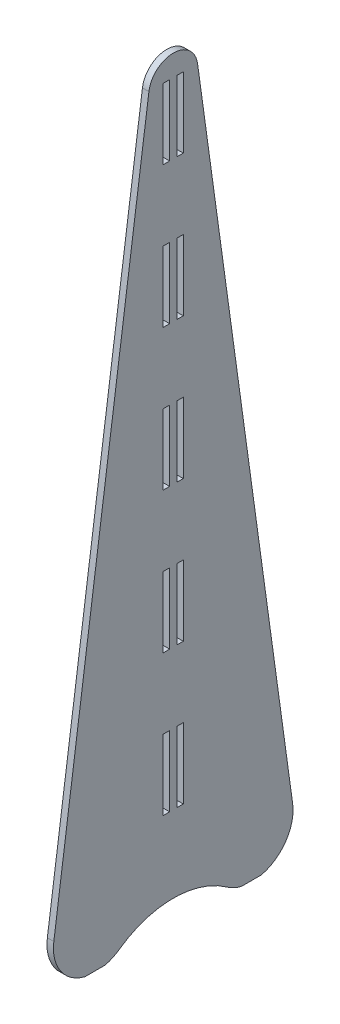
ISO-10303-21;
HEADER;
FILE_DESCRIPTION(('STEP AP214'),'2;1');
FILE_NAME('part.step','',(''),(''),'','','');
FILE_SCHEMA(('AUTOMOTIVE_DESIGN { 1 0 10303 214 1 1 1 1 }'));
ENDSEC;
DATA;
#1=APPLICATION_CONTEXT('core data for automotive mechanical design processes');
#2=APPLICATION_PROTOCOL_DEFINITION('international standard','automotive_design',2000,#1);
#3=PRODUCT_CONTEXT('',#1,'mechanical');
#4=PRODUCT('Part','Part','',(#3));
#5=PRODUCT_RELATED_PRODUCT_CATEGORY('part','',(#4));
#6=PRODUCT_DEFINITION_FORMATION('','',#4);
#7=PRODUCT_DEFINITION_CONTEXT('part definition',#1,'design');
#8=PRODUCT_DEFINITION('design','',#6,#7);
#9=PRODUCT_DEFINITION_SHAPE('','',#8);
#10=(LENGTH_UNIT() NAMED_UNIT(*) SI_UNIT(.MILLI.,.METRE.));
#11=(NAMED_UNIT(*) PLANE_ANGLE_UNIT() SI_UNIT($,.RADIAN.));
#12=(NAMED_UNIT(*) SI_UNIT($,.STERADIAN.) SOLID_ANGLE_UNIT());
#13=UNCERTAINTY_MEASURE_WITH_UNIT(LENGTH_MEASURE(1.E-05),#10,'distance_accuracy_value','');
#14=(GEOMETRIC_REPRESENTATION_CONTEXT(3) GLOBAL_UNCERTAINTY_ASSIGNED_CONTEXT((#13)) GLOBAL_UNIT_ASSIGNED_CONTEXT((#10,
#11,#12)) REPRESENTATION_CONTEXT('',''));
#15=CARTESIAN_POINT('',(0.,0.,0.));
#16=DIRECTION('',(0.,0.,1.));
#17=DIRECTION('',(1.,0.,0.));
#18=AXIS2_PLACEMENT_3D('',#15,#16,#17);
#19=CARTESIAN_POINT('',(-175.7,-168.896917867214,-36.6));
#20=DIRECTION('',(-1.,0.,0.));
#21=DIRECTION('',(0.,0.,1.));
#22=AXIS2_PLACEMENT_3D('',#19,#20,#21);
#23=CYLINDRICAL_SURFACE('',#22,18.6539964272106);
#24=CARTESIAN_POINT('',(-178.6,-168.896917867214,-36.6));
#25=DIRECTION('',(-1.,0.,0.));
#26=DIRECTION('',(0.,0.,1.));
#27=AXIS2_PLACEMENT_3D('',#24,#25,#26);
#28=CIRCLE('',#27,18.6539964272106);
#29=CARTESIAN_POINT('',(-178.6,-166.3450446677,-55.0786234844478));
#30=VERTEX_POINT('',#29);
#31=CARTESIAN_POINT('',(-178.6,-187.,-41.1));
#32=VERTEX_POINT('',#31);
#33=EDGE_CURVE('E668',#30,#32,#28,.T.);
#34=ORIENTED_EDGE('',*,*,#33,.F.);
#35=DIRECTION('',(-1.,0.,0.));
#36=VECTOR('',#35,1.);
#37=CARTESIAN_POINT('',(-175.7,-166.3450446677,-55.0786234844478));
#38=LINE('',#37,#36);
#39=CARTESIAN_POINT('',(-175.7,-166.3450446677,-55.0786234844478));
#40=VERTEX_POINT('',#39);
#41=EDGE_CURVE('E11',#40,#30,#38,.T.);
#42=ORIENTED_EDGE('',*,*,#41,.F.);
#43=CARTESIAN_POINT('',(-175.7,-168.896917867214,-36.6));
#44=DIRECTION('',(-1.,0.,0.));
#45=DIRECTION('',(0.,0.,1.));
#46=AXIS2_PLACEMENT_3D('',#43,#44,#45);
#47=CIRCLE('',#46,18.6539964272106);
#48=CARTESIAN_POINT('',(-175.7,-187.,-41.1));
#49=VERTEX_POINT('',#48);
#50=EDGE_CURVE('E675',#40,#49,#47,.T.);
#51=ORIENTED_EDGE('',*,*,#50,.T.);
#52=DIRECTION('',(-1.,0.,0.));
#53=VECTOR('',#52,1.);
#54=CARTESIAN_POINT('',(-175.7,-187.,-41.1));
#55=LINE('',#54,#53);
#56=EDGE_CURVE('E36',#49,#32,#55,.T.);
#57=ORIENTED_EDGE('',*,*,#56,.T.);
#58=EDGE_LOOP('',(#34,#42,#51,#57));
#59=FACE_BOUND('',#58,.T.);
#60=ADVANCED_FACE('F33',(#59),#23,.T.);
#61=CARTESIAN_POINT('',(-175.7,-166.3450446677,-55.0786234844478));
#62=DIRECTION('',(0.,0.136800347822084,-0.99059863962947));
#63=DIRECTION('',(0.,0.99059863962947,0.136800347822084));
#64=AXIS2_PLACEMENT_3D('',#61,#62,#63);
#65=PLANE('',#64);
#66=DIRECTION('',(0.,-0.99059863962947,-0.136800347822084));
#67=VECTOR('',#66,1.);
#68=CARTESIAN_POINT('',(-178.6,-166.3450446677,-55.0786234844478));
#69=LINE('',#68,#67);
#70=CARTESIAN_POINT('',(-178.6,142.,-12.4965850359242));
#71=VERTEX_POINT('',#70);
#72=EDGE_CURVE('E679',#71,#30,#69,.T.);
#73=ORIENTED_EDGE('',*,*,#72,.F.);
#74=DIRECTION('',(-1.,0.,0.));
#75=VECTOR('',#74,1.);
#76=CARTESIAN_POINT('',(-175.7,142.,-12.4965850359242));
#77=LINE('',#76,#75);
#78=CARTESIAN_POINT('',(-175.7,142.,-12.4965850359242));
#79=VERTEX_POINT('',#78);
#80=EDGE_CURVE('E41',#79,#71,#77,.T.);
#81=ORIENTED_EDGE('',*,*,#80,.F.);
#82=DIRECTION('',(0.,-0.99059863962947,-0.136800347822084));
#83=VECTOR('',#82,1.);
#84=CARTESIAN_POINT('',(-175.7,-166.3450446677,-55.0786234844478));
#85=LINE('',#84,#83);
#86=EDGE_CURVE('E702',#79,#40,#85,.T.);
#87=ORIENTED_EDGE('',*,*,#86,.T.);
#88=ORIENTED_EDGE('',*,*,#41,.T.);
#89=EDGE_LOOP('',(#73,#81,#87,#88));
#90=FACE_BOUND('',#89,.T.);
#91=ADVANCED_FACE('F760',(#90),#65,.T.);
#92=CARTESIAN_POINT('',(-175.7,140.495196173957,-1.6));
#93=DIRECTION('',(-1.,0.,0.));
#94=DIRECTION('',(0.,0.,1.));
#95=AXIS2_PLACEMENT_3D('',#92,#93,#94);
#96=CYLINDRICAL_SURFACE('',#95,11.);
#97=CARTESIAN_POINT('',(-178.6,140.495196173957,-1.6));
#98=DIRECTION('',(-1.,0.,0.));
#99=DIRECTION('',(0.,0.,1.));
#100=AXIS2_PLACEMENT_3D('',#97,#98,#99);
#101=CIRCLE('',#100,11.);
#102=CARTESIAN_POINT('',(-178.6,142.,9.29658503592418));
#103=VERTEX_POINT('',#102);
#104=EDGE_CURVE('E728',#103,#71,#101,.T.);
#105=ORIENTED_EDGE('',*,*,#104,.F.);
#106=DIRECTION('',(-1.,0.,0.));
#107=VECTOR('',#106,1.);
#108=CARTESIAN_POINT('',(-175.7,142.,9.29658503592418));
#109=LINE('',#108,#107);
#110=CARTESIAN_POINT('',(-175.7,142.,9.29658503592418));
#111=VERTEX_POINT('',#110);
#112=EDGE_CURVE('E734',#111,#103,#109,.T.);
#113=ORIENTED_EDGE('',*,*,#112,.F.);
#114=CARTESIAN_POINT('',(-175.7,140.495196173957,-1.6));
#115=DIRECTION('',(-1.,0.,0.));
#116=DIRECTION('',(0.,0.,-1.));
#117=AXIS2_PLACEMENT_3D('',#114,#115,#116);
#118=CIRCLE('',#117,11.);
#119=EDGE_CURVE('E700',#111,#79,#118,.T.);
#120=ORIENTED_EDGE('',*,*,#119,.T.);
#121=ORIENTED_EDGE('',*,*,#80,.T.);
#122=EDGE_LOOP('',(#105,#113,#120,#121));
#123=FACE_BOUND('',#122,.T.);
#124=ADVANCED_FACE('F788',(#123),#96,.T.);
#125=CARTESIAN_POINT('',(-175.7,-166.3450446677,51.8786234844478));
#126=DIRECTION('',(0.,0.136800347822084,0.99059863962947));
#127=DIRECTION('',(0.,-0.99059863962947,0.136800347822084));
#128=AXIS2_PLACEMENT_3D('',#125,#126,#127);
#129=PLANE('',#128);
#130=DIRECTION('',(0.,0.99059863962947,-0.136800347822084));
#131=VECTOR('',#130,1.);
#132=CARTESIAN_POINT('',(-178.6,-166.3450446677,51.8786234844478));
#133=LINE('',#132,#131);
#134=CARTESIAN_POINT('',(-178.6,-166.3450446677,51.8786234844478));
#135=VERTEX_POINT('',#134);
#136=EDGE_CURVE('E725',#135,#103,#133,.T.);
#137=ORIENTED_EDGE('',*,*,#136,.F.);
#138=DIRECTION('',(-1.,0.,0.));
#139=VECTOR('',#138,1.);
#140=CARTESIAN_POINT('',(-175.7,-166.3450446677,51.8786234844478));
#141=LINE('',#140,#139);
#142=CARTESIAN_POINT('',(-175.7,-166.3450446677,51.8786234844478));
#143=VERTEX_POINT('',#142);
#144=EDGE_CURVE('E737',#143,#135,#141,.T.);
#145=ORIENTED_EDGE('',*,*,#144,.F.);
#146=DIRECTION('',(0.,0.99059863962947,-0.136800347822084));
#147=VECTOR('',#146,1.);
#148=CARTESIAN_POINT('',(-175.7,-166.3450446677,51.8786234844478));
#149=LINE('',#148,#147);
#150=EDGE_CURVE('E697',#143,#111,#149,.T.);
#151=ORIENTED_EDGE('',*,*,#150,.T.);
#152=ORIENTED_EDGE('',*,*,#112,.T.);
#153=EDGE_LOOP('',(#137,#145,#151,#152));
#154=FACE_BOUND('',#153,.T.);
#155=ADVANCED_FACE('F786',(#154),#129,.T.);
#156=CARTESIAN_POINT('',(-175.7,-168.896917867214,33.4));
#157=DIRECTION('',(-1.,0.,0.));
#158=DIRECTION('',(0.,0.,1.));
#159=AXIS2_PLACEMENT_3D('',#156,#157,#158);
#160=CYLINDRICAL_SURFACE('',#159,18.6539964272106);
#161=CARTESIAN_POINT('',(-178.6,-168.896917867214,33.4));
#162=DIRECTION('',(-1.,0.,0.));
#163=DIRECTION('',(0.,0.,-1.));
#164=AXIS2_PLACEMENT_3D('',#161,#162,#163);
#165=CIRCLE('',#164,18.6539964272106);
#166=CARTESIAN_POINT('',(-178.6,-187.,37.9));
#167=VERTEX_POINT('',#166);
#168=EDGE_CURVE('E722',#167,#135,#165,.T.);
#169=ORIENTED_EDGE('',*,*,#168,.F.);
#170=DIRECTION('',(-1.,0.,0.));
#171=VECTOR('',#170,1.);
#172=CARTESIAN_POINT('',(-175.7,-187.,37.9));
#173=LINE('',#172,#171);
#174=CARTESIAN_POINT('',(-175.7,-187.,37.9));
#175=VERTEX_POINT('',#174);
#176=EDGE_CURVE('E739',#175,#167,#173,.T.);
#177=ORIENTED_EDGE('',*,*,#176,.F.);
#178=CARTESIAN_POINT('',(-175.7,-168.896917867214,33.4));
#179=DIRECTION('',(-1.,0.,0.));
#180=DIRECTION('',(0.,0.,-1.));
#181=AXIS2_PLACEMENT_3D('',#178,#179,#180);
#182=CIRCLE('',#181,18.6539964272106);
#183=EDGE_CURVE('E694',#175,#143,#182,.T.);
#184=ORIENTED_EDGE('',*,*,#183,.T.);
#185=ORIENTED_EDGE('',*,*,#144,.T.);
#186=EDGE_LOOP('',(#169,#177,#184,#185));
#187=FACE_BOUND('',#186,.T.);
#188=ADVANCED_FACE('F782',(#187),#160,.T.);
#189=CARTESIAN_POINT('',(-175.7,-187.,28.9));
#190=DIRECTION('',(0.,-1.,0.));
#191=DIRECTION('',(0.,0.,-1.));
#192=AXIS2_PLACEMENT_3D('',#189,#190,#191);
#193=PLANE('',#192);
#194=DIRECTION('',(0.,0.,1.));
#195=VECTOR('',#194,1.);
#196=CARTESIAN_POINT('',(-178.6,-187.,28.9));
#197=LINE('',#196,#195);
#198=CARTESIAN_POINT('',(-178.6,-187.,28.9));
#199=VERTEX_POINT('',#198);
#200=EDGE_CURVE('E719',#199,#167,#197,.T.);
#201=ORIENTED_EDGE('',*,*,#200,.F.);
#202=DIRECTION('',(-1.,0.,0.));
#203=VECTOR('',#202,1.);
#204=CARTESIAN_POINT('',(-175.7,-187.,28.9));
#205=LINE('',#204,#203);
#206=CARTESIAN_POINT('',(-175.7,-187.,28.9));
#207=VERTEX_POINT('',#206);
#208=EDGE_CURVE('E741',#207,#199,#205,.T.);
#209=ORIENTED_EDGE('',*,*,#208,.F.);
#210=DIRECTION('',(0.,0.,1.));
#211=VECTOR('',#210,1.);
#212=CARTESIAN_POINT('',(-175.7,-187.,28.9));
#213=LINE('',#212,#211);
#214=EDGE_CURVE('E691',#207,#175,#213,.T.);
#215=ORIENTED_EDGE('',*,*,#214,.T.);
#216=ORIENTED_EDGE('',*,*,#176,.T.);
#217=EDGE_LOOP('',(#201,#209,#215,#216));
#218=FACE_BOUND('',#217,.T.);
#219=ADVANCED_FACE('F778',(#218),#193,.T.);
#220=CARTESIAN_POINT('',(-175.7,-168.896917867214,33.4));
#221=DIRECTION('',(-1.,0.,0.));
#222=DIRECTION('',(0.,0.,1.));
#223=AXIS2_PLACEMENT_3D('',#220,#221,#222);
#224=CYLINDRICAL_SURFACE('',#223,18.6539964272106);
#225=CARTESIAN_POINT('',(-178.6,-168.896917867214,33.4));
#226=DIRECTION('',(-1.,0.,0.));
#227=DIRECTION('',(0.,0.,-1.));
#228=AXIS2_PLACEMENT_3D('',#225,#226,#227);
#229=CIRCLE('',#228,18.6539964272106);
#230=CARTESIAN_POINT('',(-178.6,-184.055565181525,22.5286158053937));
#231=VERTEX_POINT('',#230);
#232=EDGE_CURVE('E716',#231,#199,#229,.T.);
#233=ORIENTED_EDGE('',*,*,#232,.F.);
#234=DIRECTION('',(-1.,0.,0.));
#235=VECTOR('',#234,1.);
#236=CARTESIAN_POINT('',(-175.7,-184.055565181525,22.5286158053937));
#237=LINE('',#236,#235);
#238=CARTESIAN_POINT('',(-175.7,-184.055565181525,22.5286158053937));
#239=VERTEX_POINT('',#238);
#240=EDGE_CURVE('E743',#239,#231,#237,.T.);
#241=ORIENTED_EDGE('',*,*,#240,.F.);
#242=CARTESIAN_POINT('',(-175.7,-168.896917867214,33.4));
#243=DIRECTION('',(-1.,0.,0.));
#244=DIRECTION('',(0.,0.,-1.));
#245=AXIS2_PLACEMENT_3D('',#242,#243,#244);
#246=CIRCLE('',#245,18.6539964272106);
#247=EDGE_CURVE('E688',#239,#207,#246,.T.);
#248=ORIENTED_EDGE('',*,*,#247,.T.);
#249=ORIENTED_EDGE('',*,*,#208,.T.);
#250=EDGE_LOOP('',(#233,#241,#248,#249));
#251=FACE_BOUND('',#250,.T.);
#252=ADVANCED_FACE('F774',(#251),#224,.T.);
#253=CARTESIAN_POINT('',(-175.7,-217.699595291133,-1.59999999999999));
#254=DIRECTION('',(-1.,0.,0.));
#255=DIRECTION('',(0.,0.,1.));
#256=AXIS2_PLACEMENT_3D('',#253,#254,#255);
#257=CYLINDRICAL_SURFACE('',#256,41.4018219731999);
#258=CARTESIAN_POINT('',(-178.6,-217.699595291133,-1.59999999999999));
#259=DIRECTION('',(1.,0.,0.));
#260=DIRECTION('',(0.,0.,-1.));
#261=AXIS2_PLACEMENT_3D('',#258,#259,#260);
#262=CIRCLE('',#261,41.4018219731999);
#263=CARTESIAN_POINT('',(-178.6,-184.055565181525,-25.7286158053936));
#264=VERTEX_POINT('',#263);
#265=EDGE_CURVE('E713',#264,#231,#262,.T.);
#266=ORIENTED_EDGE('',*,*,#265,.F.);
#267=DIRECTION('',(-1.,0.,0.));
#268=VECTOR('',#267,1.);
#269=CARTESIAN_POINT('',(-175.7,-184.055565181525,-25.7286158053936));
#270=LINE('',#269,#268);
#271=CARTESIAN_POINT('',(-175.7,-184.055565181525,-25.7286158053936));
#272=VERTEX_POINT('',#271);
#273=EDGE_CURVE('E745',#272,#264,#270,.T.);
#274=ORIENTED_EDGE('',*,*,#273,.F.);
#275=CARTESIAN_POINT('',(-175.7,-217.699595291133,-1.59999999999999));
#276=DIRECTION('',(1.,0.,0.));
#277=DIRECTION('',(0.,0.,-1.));
#278=AXIS2_PLACEMENT_3D('',#275,#276,#277);
#279=CIRCLE('',#278,41.4018219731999);
#280=EDGE_CURVE('E685',#272,#239,#279,.T.);
#281=ORIENTED_EDGE('',*,*,#280,.T.);
#282=ORIENTED_EDGE('',*,*,#240,.T.);
#283=EDGE_LOOP('',(#266,#274,#281,#282));
#284=FACE_BOUND('',#283,.T.);
#285=ADVANCED_FACE('F772',(#284),#257,.F.);
#286=CARTESIAN_POINT('',(-175.7,-168.896917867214,-36.6));
#287=DIRECTION('',(-1.,0.,0.));
#288=DIRECTION('',(0.,0.,1.));
#289=AXIS2_PLACEMENT_3D('',#286,#287,#288);
#290=CYLINDRICAL_SURFACE('',#289,18.6539964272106);
#291=CARTESIAN_POINT('',(-178.6,-168.896917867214,-36.6));
#292=DIRECTION('',(-1.,0.,0.));
#293=DIRECTION('',(0.,0.,1.));
#294=AXIS2_PLACEMENT_3D('',#291,#292,#293);
#295=CIRCLE('',#294,18.6539964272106);
#296=CARTESIAN_POINT('',(-178.6,-187.,-32.1));
#297=VERTEX_POINT('',#296);
#298=EDGE_CURVE('E710',#297,#264,#295,.T.);
#299=ORIENTED_EDGE('',*,*,#298,.F.);
#300=DIRECTION('',(-1.,0.,0.));
#301=VECTOR('',#300,1.);
#302=CARTESIAN_POINT('',(-175.7,-187.,-32.1));
#303=LINE('',#302,#301);
#304=CARTESIAN_POINT('',(-175.7,-187.,-32.1));
#305=VERTEX_POINT('',#304);
#306=EDGE_CURVE('E746',#305,#297,#303,.T.);
#307=ORIENTED_EDGE('',*,*,#306,.F.);
#308=CARTESIAN_POINT('',(-175.7,-168.896917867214,-36.6));
#309=DIRECTION('',(-1.,0.,0.));
#310=DIRECTION('',(0.,0.,1.));
#311=AXIS2_PLACEMENT_3D('',#308,#309,#310);
#312=CIRCLE('',#311,18.6539964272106);
#313=EDGE_CURVE('E682',#305,#272,#312,.T.);
#314=ORIENTED_EDGE('',*,*,#313,.T.);
#315=ORIENTED_EDGE('',*,*,#273,.T.);
#316=EDGE_LOOP('',(#299,#307,#314,#315));
#317=FACE_BOUND('',#316,.T.);
#318=ADVANCED_FACE('F768',(#317),#290,.T.);
#319=CARTESIAN_POINT('',(-175.7,-187.,-32.1));
#320=DIRECTION('',(0.,-1.,0.));
#321=DIRECTION('',(0.,0.,-1.));
#322=AXIS2_PLACEMENT_3D('',#319,#320,#321);
#323=PLANE('',#322);
#324=DIRECTION('',(0.,0.,1.));
#325=VECTOR('',#324,1.);
#326=CARTESIAN_POINT('',(-178.6,-187.,-32.1));
#327=LINE('',#326,#325);
#328=EDGE_CURVE('E707',#32,#297,#327,.T.);
#329=ORIENTED_EDGE('',*,*,#328,.F.);
#330=ORIENTED_EDGE('',*,*,#56,.F.);
#331=DIRECTION('',(0.,0.,1.));
#332=VECTOR('',#331,1.);
#333=CARTESIAN_POINT('',(-175.7,-187.,-32.1));
#334=LINE('',#333,#332);
#335=EDGE_CURVE('E678',#49,#305,#334,.T.);
#336=ORIENTED_EDGE('',*,*,#335,.T.);
#337=ORIENTED_EDGE('',*,*,#306,.T.);
#338=EDGE_LOOP('',(#329,#330,#336,#337));
#339=FACE_BOUND('',#338,.T.);
#340=ADVANCED_FACE('F754',(#339),#323,.T.);
#341=CARTESIAN_POINT('',(-175.7,-168.896917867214,-36.6));
#342=DIRECTION('',(-1.,0.,0.));
#343=DIRECTION('',(0.,0.,1.));
#344=AXIS2_PLACEMENT_3D('',#341,#342,#343);
#345=PLANE('',#344);
#346=DIRECTION('',(0.,0.,-1.));
#347=VECTOR('',#346,1.);
#348=CARTESIAN_POINT('',(-175.7,-110.444444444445,0.));
#349=LINE('',#348,#347);
#350=CARTESIAN_POINT('',(-175.7,-110.444444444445,2.9));
#351=VERTEX_POINT('',#350);
#352=CARTESIAN_POINT('',(-175.7,-110.444444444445,0.));
#353=VERTEX_POINT('',#352);
#354=EDGE_CURVE('E358',#351,#353,#349,.T.);
#355=ORIENTED_EDGE('',*,*,#354,.T.);
#356=DIRECTION('',(0.,-1.,0.));
#357=VECTOR('',#356,1.);
#358=CARTESIAN_POINT('',(-175.7,-142.,0.));
#359=LINE('',#358,#357);
#360=CARTESIAN_POINT('',(-175.7,-142.,0.));
#361=VERTEX_POINT('',#360);
#362=EDGE_CURVE('E352',#353,#361,#359,.T.);
#363=ORIENTED_EDGE('',*,*,#362,.T.);
#364=DIRECTION('',(0.,0.,1.));
#365=VECTOR('',#364,1.);
#366=CARTESIAN_POINT('',(-175.7,-142.,2.9));
#367=LINE('',#366,#365);
#368=CARTESIAN_POINT('',(-175.7,-142.,2.9));
#369=VERTEX_POINT('',#368);
#370=EDGE_CURVE('E361',#361,#369,#367,.T.);
#371=ORIENTED_EDGE('',*,*,#370,.T.);
#372=DIRECTION('',(0.,1.,0.));
#373=VECTOR('',#372,1.);
#374=CARTESIAN_POINT('',(-175.7,-110.444444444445,2.9));
#375=LINE('',#374,#373);
#376=EDGE_CURVE('E49',#369,#351,#375,.T.);
#377=ORIENTED_EDGE('',*,*,#376,.T.);
#378=EDGE_LOOP('',(#355,#363,#371,#377));
#379=FACE_BOUND('',#378,.T.);
#380=DIRECTION('',(0.,0.,-1.));
#381=VECTOR('',#380,1.);
#382=CARTESIAN_POINT('',(-175.7,-47.3333333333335,0.));
#383=LINE('',#382,#381);
#384=CARTESIAN_POINT('',(-175.7,-47.3333333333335,2.9));
#385=VERTEX_POINT('',#384);
#386=CARTESIAN_POINT('',(-175.7,-47.3333333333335,0.));
#387=VERTEX_POINT('',#386);
#388=EDGE_CURVE('E397',#385,#387,#383,.T.);
#389=ORIENTED_EDGE('',*,*,#388,.T.);
#390=DIRECTION('',(0.,-1.,0.));
#391=VECTOR('',#390,1.);
#392=CARTESIAN_POINT('',(-175.7,-78.8888888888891,0.));
#393=LINE('',#392,#391);
#394=CARTESIAN_POINT('',(-175.7,-78.8888888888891,0.));
#395=VERTEX_POINT('',#394);
#396=EDGE_CURVE('E387',#387,#395,#393,.T.);
#397=ORIENTED_EDGE('',*,*,#396,.T.);
#398=DIRECTION('',(0.,0.,1.));
#399=VECTOR('',#398,1.);
#400=CARTESIAN_POINT('',(-175.7,-78.8888888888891,2.9));
#401=LINE('',#400,#399);
#402=CARTESIAN_POINT('',(-175.7,-78.8888888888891,2.9));
#403=VERTEX_POINT('',#402);
#404=EDGE_CURVE('E390',#395,#403,#401,.T.);
#405=ORIENTED_EDGE('',*,*,#404,.T.);
#406=DIRECTION('',(0.,1.,0.));
#407=VECTOR('',#406,1.);
#408=CARTESIAN_POINT('',(-175.7,-47.3333333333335,2.9));
#409=LINE('',#408,#407);
#410=EDGE_CURVE('E394',#403,#385,#409,.T.);
#411=ORIENTED_EDGE('',*,*,#410,.T.);
#412=EDGE_LOOP('',(#389,#397,#405,#411));
#413=FACE_BOUND('',#412,.T.);
#414=DIRECTION('',(0.,0.,-1.));
#415=VECTOR('',#414,1.);
#416=CARTESIAN_POINT('',(-175.7,15.7777777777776,0.));
#417=LINE('',#416,#415);
#418=CARTESIAN_POINT('',(-175.7,15.7777777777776,2.9));
#419=VERTEX_POINT('',#418);
#420=CARTESIAN_POINT('',(-175.7,15.7777777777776,0.));
#421=VERTEX_POINT('',#420);
#422=EDGE_CURVE('E429',#419,#421,#417,.T.);
#423=ORIENTED_EDGE('',*,*,#422,.T.);
#424=DIRECTION('',(0.,-1.,0.));
#425=VECTOR('',#424,1.);
#426=CARTESIAN_POINT('',(-175.7,-15.777777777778,0.));
#427=LINE('',#426,#425);
#428=CARTESIAN_POINT('',(-175.7,-15.777777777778,0.));
#429=VERTEX_POINT('',#428);
#430=EDGE_CURVE('E419',#421,#429,#427,.T.);
#431=ORIENTED_EDGE('',*,*,#430,.T.);
#432=DIRECTION('',(0.,0.,1.));
#433=VECTOR('',#432,1.);
#434=CARTESIAN_POINT('',(-175.7,-15.777777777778,2.9));
#435=LINE('',#434,#433);
#436=CARTESIAN_POINT('',(-175.7,-15.777777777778,2.9));
#437=VERTEX_POINT('',#436);
#438=EDGE_CURVE('E422',#429,#437,#435,.T.);
#439=ORIENTED_EDGE('',*,*,#438,.T.);
#440=DIRECTION('',(0.,1.,0.));
#441=VECTOR('',#440,1.);
#442=CARTESIAN_POINT('',(-175.7,15.7777777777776,2.9));
#443=LINE('',#442,#441);
#444=EDGE_CURVE('E426',#437,#419,#443,.T.);
#445=ORIENTED_EDGE('',*,*,#444,.T.);
#446=EDGE_LOOP('',(#423,#431,#439,#445));
#447=FACE_BOUND('',#446,.T.);
#448=DIRECTION('',(0.,0.,-1.));
#449=VECTOR('',#448,1.);
#450=CARTESIAN_POINT('',(-175.7,78.8888888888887,0.));
#451=LINE('',#450,#449);
#452=CARTESIAN_POINT('',(-175.7,78.8888888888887,2.9));
#453=VERTEX_POINT('',#452);
#454=CARTESIAN_POINT('',(-175.7,78.8888888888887,0.));
#455=VERTEX_POINT('',#454);
#456=EDGE_CURVE('E461',#453,#455,#451,.T.);
#457=ORIENTED_EDGE('',*,*,#456,.T.);
#458=DIRECTION('',(0.,-1.,0.));
#459=VECTOR('',#458,1.);
#460=CARTESIAN_POINT('',(-175.7,47.3333333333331,0.));
#461=LINE('',#460,#459);
#462=CARTESIAN_POINT('',(-175.7,47.3333333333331,0.));
#463=VERTEX_POINT('',#462);
#464=EDGE_CURVE('E451',#455,#463,#461,.T.);
#465=ORIENTED_EDGE('',*,*,#464,.T.);
#466=DIRECTION('',(0.,0.,1.));
#467=VECTOR('',#466,1.);
#468=CARTESIAN_POINT('',(-175.7,47.3333333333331,2.9));
#469=LINE('',#468,#467);
#470=CARTESIAN_POINT('',(-175.7,47.3333333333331,2.9));
#471=VERTEX_POINT('',#470);
#472=EDGE_CURVE('E454',#463,#471,#469,.T.);
#473=ORIENTED_EDGE('',*,*,#472,.T.);
#474=DIRECTION('',(0.,1.,0.));
#475=VECTOR('',#474,1.);
#476=CARTESIAN_POINT('',(-175.7,78.8888888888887,2.9));
#477=LINE('',#476,#475);
#478=EDGE_CURVE('E458',#471,#453,#477,.T.);
#479=ORIENTED_EDGE('',*,*,#478,.T.);
#480=EDGE_LOOP('',(#457,#465,#473,#479));
#481=FACE_BOUND('',#480,.T.);
#482=DIRECTION('',(0.,1.,0.));
#483=VECTOR('',#482,1.);
#484=CARTESIAN_POINT('',(-175.7,110.444444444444,-3.2));
#485=LINE('',#484,#483);
#486=CARTESIAN_POINT('',(-175.7,110.444444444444,-3.2));
#487=VERTEX_POINT('',#486);
#488=CARTESIAN_POINT('',(-175.7,142.,-3.2));
#489=VERTEX_POINT('',#488);
#490=EDGE_CURVE('E493',#487,#489,#485,.T.);
#491=ORIENTED_EDGE('',*,*,#490,.T.);
#492=DIRECTION('',(0.,0.,-1.));
#493=VECTOR('',#492,1.);
#494=CARTESIAN_POINT('',(-175.7,142.,-3.2));
#495=LINE('',#494,#493);
#496=CARTESIAN_POINT('',(-175.7,142.,-6.1));
#497=VERTEX_POINT('',#496);
#498=EDGE_CURVE('E483',#489,#497,#495,.T.);
#499=ORIENTED_EDGE('',*,*,#498,.T.);
#500=DIRECTION('',(0.,-1.,0.));
#501=VECTOR('',#500,1.);
#502=CARTESIAN_POINT('',(-175.7,142.,-6.1));
#503=LINE('',#502,#501);
#504=CARTESIAN_POINT('',(-175.7,110.444444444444,-6.1));
#505=VERTEX_POINT('',#504);
#506=EDGE_CURVE('E486',#497,#505,#503,.T.);
#507=ORIENTED_EDGE('',*,*,#506,.T.);
#508=DIRECTION('',(0.,0.,1.));
#509=VECTOR('',#508,1.);
#510=CARTESIAN_POINT('',(-175.7,110.444444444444,-6.1));
#511=LINE('',#510,#509);
#512=EDGE_CURVE('E490',#505,#487,#511,.T.);
#513=ORIENTED_EDGE('',*,*,#512,.T.);
#514=EDGE_LOOP('',(#491,#499,#507,#513));
#515=FACE_BOUND('',#514,.T.);
#516=DIRECTION('',(0.,1.,0.));
#517=VECTOR('',#516,1.);
#518=CARTESIAN_POINT('',(-175.7,47.3333333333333,-3.2));
#519=LINE('',#518,#517);
#520=CARTESIAN_POINT('',(-175.7,47.3333333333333,-3.2));
#521=VERTEX_POINT('',#520);
#522=CARTESIAN_POINT('',(-175.7,78.8888888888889,-3.2));
#523=VERTEX_POINT('',#522);
#524=EDGE_CURVE('E525',#521,#523,#519,.T.);
#525=ORIENTED_EDGE('',*,*,#524,.T.);
#526=DIRECTION('',(0.,0.,-1.));
#527=VECTOR('',#526,1.);
#528=CARTESIAN_POINT('',(-175.7,78.8888888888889,-3.2));
#529=LINE('',#528,#527);
#530=CARTESIAN_POINT('',(-175.7,78.8888888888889,-6.1));
#531=VERTEX_POINT('',#530);
#532=EDGE_CURVE('E515',#523,#531,#529,.T.);
#533=ORIENTED_EDGE('',*,*,#532,.T.);
#534=DIRECTION('',(0.,-1.,0.));
#535=VECTOR('',#534,1.);
#536=CARTESIAN_POINT('',(-175.7,78.8888888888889,-6.1));
#537=LINE('',#536,#535);
#538=CARTESIAN_POINT('',(-175.7,47.3333333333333,-6.1));
#539=VERTEX_POINT('',#538);
#540=EDGE_CURVE('E518',#531,#539,#537,.T.);
#541=ORIENTED_EDGE('',*,*,#540,.T.);
#542=DIRECTION('',(0.,0.,1.));
#543=VECTOR('',#542,1.);
#544=CARTESIAN_POINT('',(-175.7,47.3333333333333,-6.1));
#545=LINE('',#544,#543);
#546=EDGE_CURVE('E522',#539,#521,#545,.T.);
#547=ORIENTED_EDGE('',*,*,#546,.T.);
#548=EDGE_LOOP('',(#525,#533,#541,#547));
#549=FACE_BOUND('',#548,.T.);
#550=DIRECTION('',(0.,1.,0.));
#551=VECTOR('',#550,1.);
#552=CARTESIAN_POINT('',(-175.7,-15.7777777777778,-3.2));
#553=LINE('',#552,#551);
#554=CARTESIAN_POINT('',(-175.7,-15.7777777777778,-3.2));
#555=VERTEX_POINT('',#554);
#556=CARTESIAN_POINT('',(-175.7,15.7777777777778,-3.2));
#557=VERTEX_POINT('',#556);
#558=EDGE_CURVE('E557',#555,#557,#553,.T.);
#559=ORIENTED_EDGE('',*,*,#558,.T.);
#560=DIRECTION('',(0.,0.,-1.));
#561=VECTOR('',#560,1.);
#562=CARTESIAN_POINT('',(-175.7,15.7777777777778,-3.2));
#563=LINE('',#562,#561);
#564=CARTESIAN_POINT('',(-175.7,15.7777777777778,-6.1));
#565=VERTEX_POINT('',#564);
#566=EDGE_CURVE('E547',#557,#565,#563,.T.);
#567=ORIENTED_EDGE('',*,*,#566,.T.);
#568=DIRECTION('',(0.,-1.,0.));
#569=VECTOR('',#568,1.);
#570=CARTESIAN_POINT('',(-175.7,15.7777777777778,-6.1));
#571=LINE('',#570,#569);
#572=CARTESIAN_POINT('',(-175.7,-15.7777777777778,-6.1));
#573=VERTEX_POINT('',#572);
#574=EDGE_CURVE('E550',#565,#573,#571,.T.);
#575=ORIENTED_EDGE('',*,*,#574,.T.);
#576=DIRECTION('',(0.,0.,1.));
#577=VECTOR('',#576,1.);
#578=CARTESIAN_POINT('',(-175.7,-15.7777777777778,-6.1));
#579=LINE('',#578,#577);
#580=EDGE_CURVE('E554',#573,#555,#579,.T.);
#581=ORIENTED_EDGE('',*,*,#580,.T.);
#582=EDGE_LOOP('',(#559,#567,#575,#581));
#583=FACE_BOUND('',#582,.T.);
#584=DIRECTION('',(0.,1.,0.));
#585=VECTOR('',#584,1.);
#586=CARTESIAN_POINT('',(-175.7,-78.8888888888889,-3.2));
#587=LINE('',#586,#585);
#588=CARTESIAN_POINT('',(-175.7,-78.8888888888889,-3.2));
#589=VERTEX_POINT('',#588);
#590=CARTESIAN_POINT('',(-175.7,-47.3333333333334,-3.2));
#591=VERTEX_POINT('',#590);
#592=EDGE_CURVE('E589',#589,#591,#587,.T.);
#593=ORIENTED_EDGE('',*,*,#592,.T.);
#594=DIRECTION('',(0.,0.,-1.));
#595=VECTOR('',#594,1.);
#596=CARTESIAN_POINT('',(-175.7,-47.3333333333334,-3.2));
#597=LINE('',#596,#595);
#598=CARTESIAN_POINT('',(-175.7,-47.3333333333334,-6.1));
#599=VERTEX_POINT('',#598);
#600=EDGE_CURVE('E579',#591,#599,#597,.T.);
#601=ORIENTED_EDGE('',*,*,#600,.T.);
#602=DIRECTION('',(0.,-1.,0.));
#603=VECTOR('',#602,1.);
#604=CARTESIAN_POINT('',(-175.7,-47.3333333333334,-6.1));
#605=LINE('',#604,#603);
#606=CARTESIAN_POINT('',(-175.7,-78.8888888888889,-6.1));
#607=VERTEX_POINT('',#606);
#608=EDGE_CURVE('E582',#599,#607,#605,.T.);
#609=ORIENTED_EDGE('',*,*,#608,.T.);
#610=DIRECTION('',(0.,0.,1.));
#611=VECTOR('',#610,1.);
#612=CARTESIAN_POINT('',(-175.7,-78.8888888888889,-6.1));
#613=LINE('',#612,#611);
#614=EDGE_CURVE('E586',#607,#589,#613,.T.);
#615=ORIENTED_EDGE('',*,*,#614,.T.);
#616=EDGE_LOOP('',(#593,#601,#609,#615));
#617=FACE_BOUND('',#616,.T.);
#618=DIRECTION('',(0.,1.,0.));
#619=VECTOR('',#618,1.);
#620=CARTESIAN_POINT('',(-175.7,-142.,-3.2));
#621=LINE('',#620,#619);
#622=CARTESIAN_POINT('',(-175.7,-142.,-3.2));
#623=VERTEX_POINT('',#622);
#624=CARTESIAN_POINT('',(-175.7,-110.444444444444,-3.2));
#625=VERTEX_POINT('',#624);
#626=EDGE_CURVE('E621',#623,#625,#621,.T.);
#627=ORIENTED_EDGE('',*,*,#626,.T.);
#628=DIRECTION('',(0.,0.,-1.));
#629=VECTOR('',#628,1.);
#630=CARTESIAN_POINT('',(-175.7,-110.444444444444,-3.2));
#631=LINE('',#630,#629);
#632=CARTESIAN_POINT('',(-175.7,-110.444444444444,-6.1));
#633=VERTEX_POINT('',#632);
#634=EDGE_CURVE('E611',#625,#633,#631,.T.);
#635=ORIENTED_EDGE('',*,*,#634,.T.);
#636=DIRECTION('',(0.,-1.,0.));
#637=VECTOR('',#636,1.);
#638=CARTESIAN_POINT('',(-175.7,-110.444444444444,-6.1));
#639=LINE('',#638,#637);
#640=CARTESIAN_POINT('',(-175.7,-142.,-6.1));
#641=VERTEX_POINT('',#640);
#642=EDGE_CURVE('E614',#633,#641,#639,.T.);
#643=ORIENTED_EDGE('',*,*,#642,.T.);
#644=DIRECTION('',(0.,0.,1.));
#645=VECTOR('',#644,1.);
#646=CARTESIAN_POINT('',(-175.7,-142.,-6.1));
#647=LINE('',#646,#645);
#648=EDGE_CURVE('E618',#641,#623,#647,.T.);
#649=ORIENTED_EDGE('',*,*,#648,.T.);
#650=EDGE_LOOP('',(#627,#635,#643,#649));
#651=FACE_BOUND('',#650,.T.);
#652=DIRECTION('',(0.,0.,-1.));
#653=VECTOR('',#652,1.);
#654=CARTESIAN_POINT('',(-175.7,142.,0.));
#655=LINE('',#654,#653);
#656=CARTESIAN_POINT('',(-175.7,142.,2.9));
#657=VERTEX_POINT('',#656);
#658=CARTESIAN_POINT('',(-175.7,142.,0.));
#659=VERTEX_POINT('',#658);
#660=EDGE_CURVE('E653',#657,#659,#655,.T.);
#661=ORIENTED_EDGE('',*,*,#660,.T.);
#662=DIRECTION('',(0.,-1.,0.));
#663=VECTOR('',#662,1.);
#664=CARTESIAN_POINT('',(-175.7,110.444444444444,0.));
#665=LINE('',#664,#663);
#666=CARTESIAN_POINT('',(-175.7,110.444444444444,0.));
#667=VERTEX_POINT('',#666);
#668=EDGE_CURVE('E643',#659,#667,#665,.T.);
#669=ORIENTED_EDGE('',*,*,#668,.T.);
#670=DIRECTION('',(0.,0.,1.));
#671=VECTOR('',#670,1.);
#672=CARTESIAN_POINT('',(-175.7,110.444444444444,2.9));
#673=LINE('',#672,#671);
#674=CARTESIAN_POINT('',(-175.7,110.444444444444,2.9));
#675=VERTEX_POINT('',#674);
#676=EDGE_CURVE('E646',#667,#675,#673,.T.);
#677=ORIENTED_EDGE('',*,*,#676,.T.);
#678=DIRECTION('',(0.,1.,0.));
#679=VECTOR('',#678,1.);
#680=CARTESIAN_POINT('',(-175.7,142.,2.9));
#681=LINE('',#680,#679);
#682=EDGE_CURVE('E650',#675,#657,#681,.T.);
#683=ORIENTED_EDGE('',*,*,#682,.T.);
#684=EDGE_LOOP('',(#661,#669,#677,#683));
#685=FACE_BOUND('',#684,.T.);
#686=ORIENTED_EDGE('',*,*,#50,.F.);
#687=ORIENTED_EDGE('',*,*,#86,.F.);
#688=ORIENTED_EDGE('',*,*,#119,.F.);
#689=ORIENTED_EDGE('',*,*,#150,.F.);
#690=ORIENTED_EDGE('',*,*,#183,.F.);
#691=ORIENTED_EDGE('',*,*,#214,.F.);
#692=ORIENTED_EDGE('',*,*,#247,.F.);
#693=ORIENTED_EDGE('',*,*,#280,.F.);
#694=ORIENTED_EDGE('',*,*,#313,.F.);
#695=ORIENTED_EDGE('',*,*,#335,.F.);
#696=EDGE_LOOP('',(#686,#687,#688,#689,#690,#691,#692,#693,#694,#695));
#697=FACE_BOUND('',#696,.T.);
#698=ADVANCED_FACE('F365',(#379,#413,#447,#481,#515,#549,#583,#617,#651,#685,#697),#345,.F.);
#699=CARTESIAN_POINT('',(-178.6,-168.896917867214,-36.6));
#700=DIRECTION('',(-1.,0.,0.));
#701=DIRECTION('',(0.,0.,1.));
#702=AXIS2_PLACEMENT_3D('',#699,#700,#701);
#703=PLANE('',#702);
#704=DIRECTION('',(0.,-1.,0.));
#705=VECTOR('',#704,1.);
#706=CARTESIAN_POINT('',(-178.6,-142.,0.));
#707=LINE('',#706,#705);
#708=CARTESIAN_POINT('',(-178.6,-110.444444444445,0.));
#709=VERTEX_POINT('',#708);
#710=CARTESIAN_POINT('',(-178.6,-142.,0.));
#711=VERTEX_POINT('',#710);
#712=EDGE_CURVE('E57',#709,#711,#707,.T.);
#713=ORIENTED_EDGE('',*,*,#712,.F.);
#714=DIRECTION('',(0.,0.,-1.));
#715=VECTOR('',#714,1.);
#716=CARTESIAN_POINT('',(-178.6,-110.444444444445,0.));
#717=LINE('',#716,#715);
#718=CARTESIAN_POINT('',(-178.6,-110.444444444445,2.9));
#719=VERTEX_POINT('',#718);
#720=EDGE_CURVE('E368',#719,#709,#717,.T.);
#721=ORIENTED_EDGE('',*,*,#720,.F.);
#722=DIRECTION('',(0.,1.,0.));
#723=VECTOR('',#722,1.);
#724=CARTESIAN_POINT('',(-178.6,-110.444444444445,2.9));
#725=LINE('',#724,#723);
#726=CARTESIAN_POINT('',(-178.6,-142.,2.9));
#727=VERTEX_POINT('',#726);
#728=EDGE_CURVE('E371',#727,#719,#725,.T.);
#729=ORIENTED_EDGE('',*,*,#728,.F.);
#730=DIRECTION('',(0.,0.,1.));
#731=VECTOR('',#730,1.);
#732=CARTESIAN_POINT('',(-178.6,-142.,2.9));
#733=LINE('',#732,#731);
#734=EDGE_CURVE('E377',#711,#727,#733,.T.);
#735=ORIENTED_EDGE('',*,*,#734,.F.);
#736=EDGE_LOOP('',(#713,#721,#729,#735));
#737=FACE_BOUND('',#736,.T.);
#738=DIRECTION('',(0.,-1.,0.));
#739=VECTOR('',#738,1.);
#740=CARTESIAN_POINT('',(-178.6,-78.8888888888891,0.));
#741=LINE('',#740,#739);
#742=CARTESIAN_POINT('',(-178.6,-47.3333333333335,0.));
#743=VERTEX_POINT('',#742);
#744=CARTESIAN_POINT('',(-178.6,-78.8888888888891,0.));
#745=VERTEX_POINT('',#744);
#746=EDGE_CURVE('E383',#743,#745,#741,.T.);
#747=ORIENTED_EDGE('',*,*,#746,.F.);
#748=DIRECTION('',(0.,0.,-1.));
#749=VECTOR('',#748,1.);
#750=CARTESIAN_POINT('',(-178.6,-47.3333333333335,0.));
#751=LINE('',#750,#749);
#752=CARTESIAN_POINT('',(-178.6,-47.3333333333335,2.9));
#753=VERTEX_POINT('',#752);
#754=EDGE_CURVE('E391',#753,#743,#751,.T.);
#755=ORIENTED_EDGE('',*,*,#754,.F.);
#756=DIRECTION('',(0.,1.,0.));
#757=VECTOR('',#756,1.);
#758=CARTESIAN_POINT('',(-178.6,-47.3333333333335,2.9));
#759=LINE('',#758,#757);
#760=CARTESIAN_POINT('',(-178.6,-78.8888888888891,2.9));
#761=VERTEX_POINT('',#760);
#762=EDGE_CURVE('E405',#761,#753,#759,.T.);
#763=ORIENTED_EDGE('',*,*,#762,.F.);
#764=DIRECTION('',(0.,0.,1.));
#765=VECTOR('',#764,1.);
#766=CARTESIAN_POINT('',(-178.6,-78.8888888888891,2.9));
#767=LINE('',#766,#765);
#768=EDGE_CURVE('E402',#745,#761,#767,.T.);
#769=ORIENTED_EDGE('',*,*,#768,.F.);
#770=EDGE_LOOP('',(#747,#755,#763,#769));
#771=FACE_BOUND('',#770,.T.);
#772=DIRECTION('',(0.,-1.,0.));
#773=VECTOR('',#772,1.);
#774=CARTESIAN_POINT('',(-178.6,-15.777777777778,0.));
#775=LINE('',#774,#773);
#776=CARTESIAN_POINT('',(-178.6,15.7777777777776,0.));
#777=VERTEX_POINT('',#776);
#778=CARTESIAN_POINT('',(-178.6,-15.777777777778,0.));
#779=VERTEX_POINT('',#778);
#780=EDGE_CURVE('E412',#777,#779,#775,.T.);
#781=ORIENTED_EDGE('',*,*,#780,.F.);
#782=DIRECTION('',(0.,0.,-1.));
#783=VECTOR('',#782,1.);
#784=CARTESIAN_POINT('',(-178.6,15.7777777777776,0.));
#785=LINE('',#784,#783);
#786=CARTESIAN_POINT('',(-178.6,15.7777777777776,2.9));
#787=VERTEX_POINT('',#786);
#788=EDGE_CURVE('E423',#787,#777,#785,.T.);
#789=ORIENTED_EDGE('',*,*,#788,.F.);
#790=DIRECTION('',(0.,1.,0.));
#791=VECTOR('',#790,1.);
#792=CARTESIAN_POINT('',(-178.6,15.7777777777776,2.9));
#793=LINE('',#792,#791);
#794=CARTESIAN_POINT('',(-178.6,-15.777777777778,2.9));
#795=VERTEX_POINT('',#794);
#796=EDGE_CURVE('E437',#795,#787,#793,.T.);
#797=ORIENTED_EDGE('',*,*,#796,.F.);
#798=DIRECTION('',(0.,0.,1.));
#799=VECTOR('',#798,1.);
#800=CARTESIAN_POINT('',(-178.6,-15.777777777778,2.9));
#801=LINE('',#800,#799);
#802=EDGE_CURVE('E434',#779,#795,#801,.T.);
#803=ORIENTED_EDGE('',*,*,#802,.F.);
#804=EDGE_LOOP('',(#781,#789,#797,#803));
#805=FACE_BOUND('',#804,.T.);
#806=DIRECTION('',(0.,-1.,0.));
#807=VECTOR('',#806,1.);
#808=CARTESIAN_POINT('',(-178.6,47.3333333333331,0.));
#809=LINE('',#808,#807);
#810=CARTESIAN_POINT('',(-178.6,78.8888888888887,0.));
#811=VERTEX_POINT('',#810);
#812=CARTESIAN_POINT('',(-178.6,47.3333333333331,0.));
#813=VERTEX_POINT('',#812);
#814=EDGE_CURVE('E444',#811,#813,#809,.T.);
#815=ORIENTED_EDGE('',*,*,#814,.F.);
#816=DIRECTION('',(0.,0.,-1.));
#817=VECTOR('',#816,1.);
#818=CARTESIAN_POINT('',(-178.6,78.8888888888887,0.));
#819=LINE('',#818,#817);
#820=CARTESIAN_POINT('',(-178.6,78.8888888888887,2.9));
#821=VERTEX_POINT('',#820);
#822=EDGE_CURVE('E455',#821,#811,#819,.T.);
#823=ORIENTED_EDGE('',*,*,#822,.F.);
#824=DIRECTION('',(0.,1.,0.));
#825=VECTOR('',#824,1.);
#826=CARTESIAN_POINT('',(-178.6,78.8888888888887,2.9));
#827=LINE('',#826,#825);
#828=CARTESIAN_POINT('',(-178.6,47.3333333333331,2.9));
#829=VERTEX_POINT('',#828);
#830=EDGE_CURVE('E469',#829,#821,#827,.T.);
#831=ORIENTED_EDGE('',*,*,#830,.F.);
#832=DIRECTION('',(0.,0.,1.));
#833=VECTOR('',#832,1.);
#834=CARTESIAN_POINT('',(-178.6,47.3333333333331,2.9));
#835=LINE('',#834,#833);
#836=EDGE_CURVE('E466',#813,#829,#835,.T.);
#837=ORIENTED_EDGE('',*,*,#836,.F.);
#838=EDGE_LOOP('',(#815,#823,#831,#837));
#839=FACE_BOUND('',#838,.T.);
#840=DIRECTION('',(0.,0.,-1.));
#841=VECTOR('',#840,1.);
#842=CARTESIAN_POINT('',(-178.6,142.,-3.2));
#843=LINE('',#842,#841);
#844=CARTESIAN_POINT('',(-178.6,142.,-3.2));
#845=VERTEX_POINT('',#844);
#846=CARTESIAN_POINT('',(-178.6,142.,-6.1));
#847=VERTEX_POINT('',#846);
#848=EDGE_CURVE('E476',#845,#847,#843,.T.);
#849=ORIENTED_EDGE('',*,*,#848,.F.);
#850=DIRECTION('',(0.,1.,0.));
#851=VECTOR('',#850,1.);
#852=CARTESIAN_POINT('',(-178.6,110.444444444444,-3.2));
#853=LINE('',#852,#851);
#854=CARTESIAN_POINT('',(-178.6,110.444444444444,-3.2));
#855=VERTEX_POINT('',#854);
#856=EDGE_CURVE('E487',#855,#845,#853,.T.);
#857=ORIENTED_EDGE('',*,*,#856,.F.);
#858=DIRECTION('',(0.,0.,1.));
#859=VECTOR('',#858,1.);
#860=CARTESIAN_POINT('',(-178.6,110.444444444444,-6.1));
#861=LINE('',#860,#859);
#862=CARTESIAN_POINT('',(-178.6,110.444444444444,-6.1));
#863=VERTEX_POINT('',#862);
#864=EDGE_CURVE('E501',#863,#855,#861,.T.);
#865=ORIENTED_EDGE('',*,*,#864,.F.);
#866=DIRECTION('',(0.,-1.,0.));
#867=VECTOR('',#866,1.);
#868=CARTESIAN_POINT('',(-178.6,142.,-6.1));
#869=LINE('',#868,#867);
#870=EDGE_CURVE('E498',#847,#863,#869,.T.);
#871=ORIENTED_EDGE('',*,*,#870,.F.);
#872=EDGE_LOOP('',(#849,#857,#865,#871));
#873=FACE_BOUND('',#872,.T.);
#874=DIRECTION('',(0.,0.,-1.));
#875=VECTOR('',#874,1.);
#876=CARTESIAN_POINT('',(-178.6,78.8888888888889,-3.2));
#877=LINE('',#876,#875);
#878=CARTESIAN_POINT('',(-178.6,78.8888888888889,-3.2));
#879=VERTEX_POINT('',#878);
#880=CARTESIAN_POINT('',(-178.6,78.8888888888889,-6.1));
#881=VERTEX_POINT('',#880);
#882=EDGE_CURVE('E508',#879,#881,#877,.T.);
#883=ORIENTED_EDGE('',*,*,#882,.F.);
#884=DIRECTION('',(0.,1.,0.));
#885=VECTOR('',#884,1.);
#886=CARTESIAN_POINT('',(-178.6,47.3333333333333,-3.2));
#887=LINE('',#886,#885);
#888=CARTESIAN_POINT('',(-178.6,47.3333333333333,-3.2));
#889=VERTEX_POINT('',#888);
#890=EDGE_CURVE('E519',#889,#879,#887,.T.);
#891=ORIENTED_EDGE('',*,*,#890,.F.);
#892=DIRECTION('',(0.,0.,1.));
#893=VECTOR('',#892,1.);
#894=CARTESIAN_POINT('',(-178.6,47.3333333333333,-6.1));
#895=LINE('',#894,#893);
#896=CARTESIAN_POINT('',(-178.6,47.3333333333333,-6.1));
#897=VERTEX_POINT('',#896);
#898=EDGE_CURVE('E533',#897,#889,#895,.T.);
#899=ORIENTED_EDGE('',*,*,#898,.F.);
#900=DIRECTION('',(0.,-1.,0.));
#901=VECTOR('',#900,1.);
#902=CARTESIAN_POINT('',(-178.6,78.8888888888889,-6.1));
#903=LINE('',#902,#901);
#904=EDGE_CURVE('E530',#881,#897,#903,.T.);
#905=ORIENTED_EDGE('',*,*,#904,.F.);
#906=EDGE_LOOP('',(#883,#891,#899,#905));
#907=FACE_BOUND('',#906,.T.);
#908=DIRECTION('',(0.,0.,-1.));
#909=VECTOR('',#908,1.);
#910=CARTESIAN_POINT('',(-178.6,15.7777777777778,-3.2));
#911=LINE('',#910,#909);
#912=CARTESIAN_POINT('',(-178.6,15.7777777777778,-3.2));
#913=VERTEX_POINT('',#912);
#914=CARTESIAN_POINT('',(-178.6,15.7777777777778,-6.1));
#915=VERTEX_POINT('',#914);
#916=EDGE_CURVE('E540',#913,#915,#911,.T.);
#917=ORIENTED_EDGE('',*,*,#916,.F.);
#918=DIRECTION('',(0.,1.,0.));
#919=VECTOR('',#918,1.);
#920=CARTESIAN_POINT('',(-178.6,-15.7777777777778,-3.2));
#921=LINE('',#920,#919);
#922=CARTESIAN_POINT('',(-178.6,-15.7777777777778,-3.2));
#923=VERTEX_POINT('',#922);
#924=EDGE_CURVE('E551',#923,#913,#921,.T.);
#925=ORIENTED_EDGE('',*,*,#924,.F.);
#926=DIRECTION('',(0.,0.,1.));
#927=VECTOR('',#926,1.);
#928=CARTESIAN_POINT('',(-178.6,-15.7777777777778,-6.1));
#929=LINE('',#928,#927);
#930=CARTESIAN_POINT('',(-178.6,-15.7777777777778,-6.1));
#931=VERTEX_POINT('',#930);
#932=EDGE_CURVE('E565',#931,#923,#929,.T.);
#933=ORIENTED_EDGE('',*,*,#932,.F.);
#934=DIRECTION('',(0.,-1.,0.));
#935=VECTOR('',#934,1.);
#936=CARTESIAN_POINT('',(-178.6,15.7777777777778,-6.1));
#937=LINE('',#936,#935);
#938=EDGE_CURVE('E562',#915,#931,#937,.T.);
#939=ORIENTED_EDGE('',*,*,#938,.F.);
#940=EDGE_LOOP('',(#917,#925,#933,#939));
#941=FACE_BOUND('',#940,.T.);
#942=DIRECTION('',(0.,0.,-1.));
#943=VECTOR('',#942,1.);
#944=CARTESIAN_POINT('',(-178.6,-47.3333333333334,-3.2));
#945=LINE('',#944,#943);
#946=CARTESIAN_POINT('',(-178.6,-47.3333333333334,-3.2));
#947=VERTEX_POINT('',#946);
#948=CARTESIAN_POINT('',(-178.6,-47.3333333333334,-6.1));
#949=VERTEX_POINT('',#948);
#950=EDGE_CURVE('E572',#947,#949,#945,.T.);
#951=ORIENTED_EDGE('',*,*,#950,.F.);
#952=DIRECTION('',(0.,1.,0.));
#953=VECTOR('',#952,1.);
#954=CARTESIAN_POINT('',(-178.6,-78.8888888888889,-3.2));
#955=LINE('',#954,#953);
#956=CARTESIAN_POINT('',(-178.6,-78.8888888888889,-3.2));
#957=VERTEX_POINT('',#956);
#958=EDGE_CURVE('E583',#957,#947,#955,.T.);
#959=ORIENTED_EDGE('',*,*,#958,.F.);
#960=DIRECTION('',(0.,0.,1.));
#961=VECTOR('',#960,1.);
#962=CARTESIAN_POINT('',(-178.6,-78.8888888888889,-6.1));
#963=LINE('',#962,#961);
#964=CARTESIAN_POINT('',(-178.6,-78.8888888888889,-6.1));
#965=VERTEX_POINT('',#964);
#966=EDGE_CURVE('E597',#965,#957,#963,.T.);
#967=ORIENTED_EDGE('',*,*,#966,.F.);
#968=DIRECTION('',(0.,-1.,0.));
#969=VECTOR('',#968,1.);
#970=CARTESIAN_POINT('',(-178.6,-47.3333333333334,-6.1));
#971=LINE('',#970,#969);
#972=EDGE_CURVE('E594',#949,#965,#971,.T.);
#973=ORIENTED_EDGE('',*,*,#972,.F.);
#974=EDGE_LOOP('',(#951,#959,#967,#973));
#975=FACE_BOUND('',#974,.T.);
#976=DIRECTION('',(0.,0.,-1.));
#977=VECTOR('',#976,1.);
#978=CARTESIAN_POINT('',(-178.6,-110.444444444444,-3.2));
#979=LINE('',#978,#977);
#980=CARTESIAN_POINT('',(-178.6,-110.444444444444,-3.2));
#981=VERTEX_POINT('',#980);
#982=CARTESIAN_POINT('',(-178.6,-110.444444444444,-6.1));
#983=VERTEX_POINT('',#982);
#984=EDGE_CURVE('E604',#981,#983,#979,.T.);
#985=ORIENTED_EDGE('',*,*,#984,.F.);
#986=DIRECTION('',(0.,1.,0.));
#987=VECTOR('',#986,1.);
#988=CARTESIAN_POINT('',(-178.6,-142.,-3.2));
#989=LINE('',#988,#987);
#990=CARTESIAN_POINT('',(-178.6,-142.,-3.2));
#991=VERTEX_POINT('',#990);
#992=EDGE_CURVE('E615',#991,#981,#989,.T.);
#993=ORIENTED_EDGE('',*,*,#992,.F.);
#994=DIRECTION('',(0.,0.,1.));
#995=VECTOR('',#994,1.);
#996=CARTESIAN_POINT('',(-178.6,-142.,-6.1));
#997=LINE('',#996,#995);
#998=CARTESIAN_POINT('',(-178.6,-142.,-6.1));
#999=VERTEX_POINT('',#998);
#1000=EDGE_CURVE('E629',#999,#991,#997,.T.);
#1001=ORIENTED_EDGE('',*,*,#1000,.F.);
#1002=DIRECTION('',(0.,-1.,0.));
#1003=VECTOR('',#1002,1.);
#1004=CARTESIAN_POINT('',(-178.6,-110.444444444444,-6.1));
#1005=LINE('',#1004,#1003);
#1006=EDGE_CURVE('E626',#983,#999,#1005,.T.);
#1007=ORIENTED_EDGE('',*,*,#1006,.F.);
#1008=EDGE_LOOP('',(#985,#993,#1001,#1007));
#1009=FACE_BOUND('',#1008,.T.);
#1010=DIRECTION('',(0.,-1.,0.));
#1011=VECTOR('',#1010,1.);
#1012=CARTESIAN_POINT('',(-178.6,110.444444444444,0.));
#1013=LINE('',#1012,#1011);
#1014=CARTESIAN_POINT('',(-178.6,142.,0.));
#1015=VERTEX_POINT('',#1014);
#1016=CARTESIAN_POINT('',(-178.6,110.444444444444,0.));
#1017=VERTEX_POINT('',#1016);
#1018=EDGE_CURVE('E636',#1015,#1017,#1013,.T.);
#1019=ORIENTED_EDGE('',*,*,#1018,.F.);
#1020=DIRECTION('',(0.,0.,-1.));
#1021=VECTOR('',#1020,1.);
#1022=CARTESIAN_POINT('',(-178.6,142.,0.));
#1023=LINE('',#1022,#1021);
#1024=CARTESIAN_POINT('',(-178.6,142.,2.9));
#1025=VERTEX_POINT('',#1024);
#1026=EDGE_CURVE('E647',#1025,#1015,#1023,.T.);
#1027=ORIENTED_EDGE('',*,*,#1026,.F.);
#1028=DIRECTION('',(0.,1.,0.));
#1029=VECTOR('',#1028,1.);
#1030=CARTESIAN_POINT('',(-178.6,142.,2.9));
#1031=LINE('',#1030,#1029);
#1032=CARTESIAN_POINT('',(-178.6,110.444444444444,2.9));
#1033=VERTEX_POINT('',#1032);
#1034=EDGE_CURVE('E661',#1033,#1025,#1031,.T.);
#1035=ORIENTED_EDGE('',*,*,#1034,.F.);
#1036=DIRECTION('',(0.,0.,1.));
#1037=VECTOR('',#1036,1.);
#1038=CARTESIAN_POINT('',(-178.6,110.444444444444,2.9));
#1039=LINE('',#1038,#1037);
#1040=EDGE_CURVE('E658',#1017,#1033,#1039,.T.);
#1041=ORIENTED_EDGE('',*,*,#1040,.F.);
#1042=EDGE_LOOP('',(#1019,#1027,#1035,#1041));
#1043=FACE_BOUND('',#1042,.T.);
#1044=ORIENTED_EDGE('',*,*,#33,.T.);
#1045=ORIENTED_EDGE('',*,*,#328,.T.);
#1046=ORIENTED_EDGE('',*,*,#298,.T.);
#1047=ORIENTED_EDGE('',*,*,#265,.T.);
#1048=ORIENTED_EDGE('',*,*,#232,.T.);
#1049=ORIENTED_EDGE('',*,*,#200,.T.);
#1050=ORIENTED_EDGE('',*,*,#168,.T.);
#1051=ORIENTED_EDGE('',*,*,#136,.T.);
#1052=ORIENTED_EDGE('',*,*,#104,.T.);
#1053=ORIENTED_EDGE('',*,*,#72,.T.);
#1054=EDGE_LOOP('',(#1044,#1045,#1046,#1047,#1048,#1049,#1050,#1051,#1052,#1053));
#1055=FACE_BOUND('',#1054,.T.);
#1056=ADVANCED_FACE('F756',(#737,#771,#805,#839,#873,#907,#941,#975,#1009,#1043,#1055),#703,.T.);
#1057=CARTESIAN_POINT('',(-175.7,110.444444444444,0.));
#1058=DIRECTION('',(0.,0.,-1.));
#1059=DIRECTION('',(0.,1.,0.));
#1060=AXIS2_PLACEMENT_3D('',#1057,#1058,#1059);
#1061=PLANE('',#1060);
#1062=ORIENTED_EDGE('',*,*,#1018,.T.);
#1063=DIRECTION('',(-1.,0.,0.));
#1064=VECTOR('',#1063,1.);
#1065=CARTESIAN_POINT('',(-175.7,110.444444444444,0.));
#1066=LINE('',#1065,#1064);
#1067=EDGE_CURVE('E656',#667,#1017,#1066,.T.);
#1068=ORIENTED_EDGE('',*,*,#1067,.F.);
#1069=ORIENTED_EDGE('',*,*,#668,.F.);
#1070=DIRECTION('',(-1.,0.,0.));
#1071=VECTOR('',#1070,1.);
#1072=CARTESIAN_POINT('',(-175.7,142.,0.));
#1073=LINE('',#1072,#1071);
#1074=EDGE_CURVE('E666',#659,#1015,#1073,.T.);
#1075=ORIENTED_EDGE('',*,*,#1074,.T.);
#1076=EDGE_LOOP('',(#1062,#1068,#1069,#1075));
#1077=FACE_BOUND('',#1076,.T.);
#1078=ADVANCED_FACE('F879',(#1077),#1061,.F.);
#1079=CARTESIAN_POINT('',(-175.7,142.,0.));
#1080=DIRECTION('',(0.,1.,0.));
#1081=DIRECTION('',(0.,0.,1.));
#1082=AXIS2_PLACEMENT_3D('',#1079,#1080,#1081);
#1083=PLANE('',#1082);
#1084=ORIENTED_EDGE('',*,*,#1026,.T.);
#1085=ORIENTED_EDGE('',*,*,#1074,.F.);
#1086=ORIENTED_EDGE('',*,*,#660,.F.);
#1087=DIRECTION('',(-1.,0.,0.));
#1088=VECTOR('',#1087,1.);
#1089=CARTESIAN_POINT('',(-175.7,142.,2.9));
#1090=LINE('',#1089,#1088);
#1091=EDGE_CURVE('E669',#657,#1025,#1090,.T.);
#1092=ORIENTED_EDGE('',*,*,#1091,.T.);
#1093=EDGE_LOOP('',(#1084,#1085,#1086,#1092));
#1094=FACE_BOUND('',#1093,.T.);
#1095=ADVANCED_FACE('F889',(#1094),#1083,.F.);
#1096=CARTESIAN_POINT('',(-175.7,142.,2.9));
#1097=DIRECTION('',(0.,0.,1.));
#1098=DIRECTION('',(1.,0.,0.));
#1099=AXIS2_PLACEMENT_3D('',#1096,#1097,#1098);
#1100=PLANE('',#1099);
#1101=ORIENTED_EDGE('',*,*,#1034,.T.);
#1102=ORIENTED_EDGE('',*,*,#1091,.F.);
#1103=ORIENTED_EDGE('',*,*,#682,.F.);
#1104=DIRECTION('',(-1.,0.,0.));
#1105=VECTOR('',#1104,1.);
#1106=CARTESIAN_POINT('',(-175.7,110.444444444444,2.9));
#1107=LINE('',#1106,#1105);
#1108=EDGE_CURVE('E671',#675,#1033,#1107,.T.);
#1109=ORIENTED_EDGE('',*,*,#1108,.T.);
#1110=EDGE_LOOP('',(#1101,#1102,#1103,#1109));
#1111=FACE_BOUND('',#1110,.T.);
#1112=ADVANCED_FACE('F899',(#1111),#1100,.F.);
#1113=CARTESIAN_POINT('',(-175.7,110.444444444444,2.9));
#1114=DIRECTION('',(0.,-1.,0.));
#1115=DIRECTION('',(0.,0.,-1.));
#1116=AXIS2_PLACEMENT_3D('',#1113,#1114,#1115);
#1117=PLANE('',#1116);
#1118=ORIENTED_EDGE('',*,*,#1040,.T.);
#1119=ORIENTED_EDGE('',*,*,#1108,.F.);
#1120=ORIENTED_EDGE('',*,*,#676,.F.);
#1121=ORIENTED_EDGE('',*,*,#1067,.T.);
#1122=EDGE_LOOP('',(#1118,#1119,#1120,#1121));
#1123=FACE_BOUND('',#1122,.T.);
#1124=ADVANCED_FACE('F909',(#1123),#1117,.F.);
#1125=CARTESIAN_POINT('',(-175.7,-110.444444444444,-3.2));
#1126=DIRECTION('',(0.,1.,0.));
#1127=DIRECTION('',(0.,0.,1.));
#1128=AXIS2_PLACEMENT_3D('',#1125,#1126,#1127);
#1129=PLANE('',#1128);
#1130=ORIENTED_EDGE('',*,*,#984,.T.);
#1131=DIRECTION('',(-1.,0.,0.));
#1132=VECTOR('',#1131,1.);
#1133=CARTESIAN_POINT('',(-175.7,-110.444444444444,-6.1));
#1134=LINE('',#1133,#1132);
#1135=EDGE_CURVE('E624',#633,#983,#1134,.T.);
#1136=ORIENTED_EDGE('',*,*,#1135,.F.);
#1137=ORIENTED_EDGE('',*,*,#634,.F.);
#1138=DIRECTION('',(-1.,0.,0.));
#1139=VECTOR('',#1138,1.);
#1140=CARTESIAN_POINT('',(-175.7,-110.444444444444,-3.2));
#1141=LINE('',#1140,#1139);
#1142=EDGE_CURVE('E634',#625,#981,#1141,.T.);
#1143=ORIENTED_EDGE('',*,*,#1142,.T.);
#1144=EDGE_LOOP('',(#1130,#1136,#1137,#1143));
#1145=FACE_BOUND('',#1144,.T.);
#1146=ADVANCED_FACE('F919',(#1145),#1129,.F.);
#1147=CARTESIAN_POINT('',(-175.7,-142.,-3.2));
#1148=DIRECTION('',(0.,0.,1.));
#1149=DIRECTION('',(1.,0.,0.));
#1150=AXIS2_PLACEMENT_3D('',#1147,#1148,#1149);
#1151=PLANE('',#1150);
#1152=ORIENTED_EDGE('',*,*,#992,.T.);
#1153=ORIENTED_EDGE('',*,*,#1142,.F.);
#1154=ORIENTED_EDGE('',*,*,#626,.F.);
#1155=DIRECTION('',(-1.,0.,0.));
#1156=VECTOR('',#1155,1.);
#1157=CARTESIAN_POINT('',(-175.7,-142.,-3.2));
#1158=LINE('',#1157,#1156);
#1159=EDGE_CURVE('E637',#623,#991,#1158,.T.);
#1160=ORIENTED_EDGE('',*,*,#1159,.T.);
#1161=EDGE_LOOP('',(#1152,#1153,#1154,#1160));
#1162=FACE_BOUND('',#1161,.T.);
#1163=ADVANCED_FACE('F929',(#1162),#1151,.F.);
#1164=CARTESIAN_POINT('',(-175.7,-142.,-6.1));
#1165=DIRECTION('',(0.,-1.,0.));
#1166=DIRECTION('',(0.,0.,-1.));
#1167=AXIS2_PLACEMENT_3D('',#1164,#1165,#1166);
#1168=PLANE('',#1167);
#1169=ORIENTED_EDGE('',*,*,#1000,.T.);
#1170=ORIENTED_EDGE('',*,*,#1159,.F.);
#1171=ORIENTED_EDGE('',*,*,#648,.F.);
#1172=DIRECTION('',(-1.,0.,0.));
#1173=VECTOR('',#1172,1.);
#1174=CARTESIAN_POINT('',(-175.7,-142.,-6.1));
#1175=LINE('',#1174,#1173);
#1176=EDGE_CURVE('E639',#641,#999,#1175,.T.);
#1177=ORIENTED_EDGE('',*,*,#1176,.T.);
#1178=EDGE_LOOP('',(#1169,#1170,#1171,#1177));
#1179=FACE_BOUND('',#1178,.T.);
#1180=ADVANCED_FACE('F939',(#1179),#1168,.F.);
#1181=CARTESIAN_POINT('',(-175.7,-110.444444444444,-6.1));
#1182=DIRECTION('',(0.,0.,-1.));
#1183=DIRECTION('',(-1.,0.,0.));
#1184=AXIS2_PLACEMENT_3D('',#1181,#1182,#1183);
#1185=PLANE('',#1184);
#1186=ORIENTED_EDGE('',*,*,#1006,.T.);
#1187=ORIENTED_EDGE('',*,*,#1176,.F.);
#1188=ORIENTED_EDGE('',*,*,#642,.F.);
#1189=ORIENTED_EDGE('',*,*,#1135,.T.);
#1190=EDGE_LOOP('',(#1186,#1187,#1188,#1189));
#1191=FACE_BOUND('',#1190,.T.);
#1192=ADVANCED_FACE('F949',(#1191),#1185,.F.);
#1193=CARTESIAN_POINT('',(-175.7,-47.3333333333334,-3.2));
#1194=DIRECTION('',(0.,1.,0.));
#1195=DIRECTION('',(0.,0.,1.));
#1196=AXIS2_PLACEMENT_3D('',#1193,#1194,#1195);
#1197=PLANE('',#1196);
#1198=ORIENTED_EDGE('',*,*,#950,.T.);
#1199=DIRECTION('',(-1.,0.,0.));
#1200=VECTOR('',#1199,1.);
#1201=CARTESIAN_POINT('',(-175.7,-47.3333333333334,-6.1));
#1202=LINE('',#1201,#1200);
#1203=EDGE_CURVE('E592',#599,#949,#1202,.T.);
#1204=ORIENTED_EDGE('',*,*,#1203,.F.);
#1205=ORIENTED_EDGE('',*,*,#600,.F.);
#1206=DIRECTION('',(-1.,0.,0.));
#1207=VECTOR('',#1206,1.);
#1208=CARTESIAN_POINT('',(-175.7,-47.3333333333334,-3.2));
#1209=LINE('',#1208,#1207);
#1210=EDGE_CURVE('E602',#591,#947,#1209,.T.);
#1211=ORIENTED_EDGE('',*,*,#1210,.T.);
#1212=EDGE_LOOP('',(#1198,#1204,#1205,#1211));
#1213=FACE_BOUND('',#1212,.T.);
#1214=ADVANCED_FACE('F959',(#1213),#1197,.F.);
#1215=CARTESIAN_POINT('',(-175.7,-78.8888888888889,-3.2));
#1216=DIRECTION('',(0.,0.,1.));
#1217=DIRECTION('',(1.,0.,0.));
#1218=AXIS2_PLACEMENT_3D('',#1215,#1216,#1217);
#1219=PLANE('',#1218);
#1220=ORIENTED_EDGE('',*,*,#958,.T.);
#1221=ORIENTED_EDGE('',*,*,#1210,.F.);
#1222=ORIENTED_EDGE('',*,*,#592,.F.);
#1223=DIRECTION('',(-1.,0.,0.));
#1224=VECTOR('',#1223,1.);
#1225=CARTESIAN_POINT('',(-175.7,-78.8888888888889,-3.2));
#1226=LINE('',#1225,#1224);
#1227=EDGE_CURVE('E605',#589,#957,#1226,.T.);
#1228=ORIENTED_EDGE('',*,*,#1227,.T.);
#1229=EDGE_LOOP('',(#1220,#1221,#1222,#1228));
#1230=FACE_BOUND('',#1229,.T.);
#1231=ADVANCED_FACE('F969',(#1230),#1219,.F.);
#1232=CARTESIAN_POINT('',(-175.7,-78.8888888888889,-6.1));
#1233=DIRECTION('',(0.,-1.,0.));
#1234=DIRECTION('',(0.,0.,-1.));
#1235=AXIS2_PLACEMENT_3D('',#1232,#1233,#1234);
#1236=PLANE('',#1235);
#1237=ORIENTED_EDGE('',*,*,#966,.T.);
#1238=ORIENTED_EDGE('',*,*,#1227,.F.);
#1239=ORIENTED_EDGE('',*,*,#614,.F.);
#1240=DIRECTION('',(-1.,0.,0.));
#1241=VECTOR('',#1240,1.);
#1242=CARTESIAN_POINT('',(-175.7,-78.8888888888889,-6.1));
#1243=LINE('',#1242,#1241);
#1244=EDGE_CURVE('E607',#607,#965,#1243,.T.);
#1245=ORIENTED_EDGE('',*,*,#1244,.T.);
#1246=EDGE_LOOP('',(#1237,#1238,#1239,#1245));
#1247=FACE_BOUND('',#1246,.T.);
#1248=ADVANCED_FACE('F979',(#1247),#1236,.F.);
#1249=CARTESIAN_POINT('',(-175.7,-47.3333333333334,-6.1));
#1250=DIRECTION('',(0.,0.,-1.));
#1251=DIRECTION('',(-1.,0.,0.));
#1252=AXIS2_PLACEMENT_3D('',#1249,#1250,#1251);
#1253=PLANE('',#1252);
#1254=ORIENTED_EDGE('',*,*,#972,.T.);
#1255=ORIENTED_EDGE('',*,*,#1244,.F.);
#1256=ORIENTED_EDGE('',*,*,#608,.F.);
#1257=ORIENTED_EDGE('',*,*,#1203,.T.);
#1258=EDGE_LOOP('',(#1254,#1255,#1256,#1257));
#1259=FACE_BOUND('',#1258,.T.);
#1260=ADVANCED_FACE('F989',(#1259),#1253,.F.);
#1261=CARTESIAN_POINT('',(-175.7,15.7777777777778,-3.2));
#1262=DIRECTION('',(0.,1.,0.));
#1263=DIRECTION('',(0.,0.,1.));
#1264=AXIS2_PLACEMENT_3D('',#1261,#1262,#1263);
#1265=PLANE('',#1264);
#1266=ORIENTED_EDGE('',*,*,#916,.T.);
#1267=DIRECTION('',(-1.,0.,0.));
#1268=VECTOR('',#1267,1.);
#1269=CARTESIAN_POINT('',(-175.7,15.7777777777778,-6.1));
#1270=LINE('',#1269,#1268);
#1271=EDGE_CURVE('E560',#565,#915,#1270,.T.);
#1272=ORIENTED_EDGE('',*,*,#1271,.F.);
#1273=ORIENTED_EDGE('',*,*,#566,.F.);
#1274=DIRECTION('',(-1.,0.,0.));
#1275=VECTOR('',#1274,1.);
#1276=CARTESIAN_POINT('',(-175.7,15.7777777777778,-3.2));
#1277=LINE('',#1276,#1275);
#1278=EDGE_CURVE('E570',#557,#913,#1277,.T.);
#1279=ORIENTED_EDGE('',*,*,#1278,.T.);
#1280=EDGE_LOOP('',(#1266,#1272,#1273,#1279));
#1281=FACE_BOUND('',#1280,.T.);
#1282=ADVANCED_FACE('F999',(#1281),#1265,.F.);
#1283=CARTESIAN_POINT('',(-175.7,-15.7777777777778,-3.2));
#1284=DIRECTION('',(0.,0.,1.));
#1285=DIRECTION('',(1.,0.,0.));
#1286=AXIS2_PLACEMENT_3D('',#1283,#1284,#1285);
#1287=PLANE('',#1286);
#1288=ORIENTED_EDGE('',*,*,#924,.T.);
#1289=ORIENTED_EDGE('',*,*,#1278,.F.);
#1290=ORIENTED_EDGE('',*,*,#558,.F.);
#1291=DIRECTION('',(-1.,0.,0.));
#1292=VECTOR('',#1291,1.);
#1293=CARTESIAN_POINT('',(-175.7,-15.7777777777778,-3.2));
#1294=LINE('',#1293,#1292);
#1295=EDGE_CURVE('E573',#555,#923,#1294,.T.);
#1296=ORIENTED_EDGE('',*,*,#1295,.T.);
#1297=EDGE_LOOP('',(#1288,#1289,#1290,#1296));
#1298=FACE_BOUND('',#1297,.T.);
#1299=ADVANCED_FACE('F1009',(#1298),#1287,.F.);
#1300=CARTESIAN_POINT('',(-175.7,-15.7777777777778,-6.1));
#1301=DIRECTION('',(0.,-1.,0.));
#1302=DIRECTION('',(0.,0.,-1.));
#1303=AXIS2_PLACEMENT_3D('',#1300,#1301,#1302);
#1304=PLANE('',#1303);
#1305=ORIENTED_EDGE('',*,*,#932,.T.);
#1306=ORIENTED_EDGE('',*,*,#1295,.F.);
#1307=ORIENTED_EDGE('',*,*,#580,.F.);
#1308=DIRECTION('',(-1.,0.,0.));
#1309=VECTOR('',#1308,1.);
#1310=CARTESIAN_POINT('',(-175.7,-15.7777777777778,-6.1));
#1311=LINE('',#1310,#1309);
#1312=EDGE_CURVE('E575',#573,#931,#1311,.T.);
#1313=ORIENTED_EDGE('',*,*,#1312,.T.);
#1314=EDGE_LOOP('',(#1305,#1306,#1307,#1313));
#1315=FACE_BOUND('',#1314,.T.);
#1316=ADVANCED_FACE('F1019',(#1315),#1304,.F.);
#1317=CARTESIAN_POINT('',(-175.7,15.7777777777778,-6.1));
#1318=DIRECTION('',(0.,0.,-1.));
#1319=DIRECTION('',(-1.,0.,0.));
#1320=AXIS2_PLACEMENT_3D('',#1317,#1318,#1319);
#1321=PLANE('',#1320);
#1322=ORIENTED_EDGE('',*,*,#938,.T.);
#1323=ORIENTED_EDGE('',*,*,#1312,.F.);
#1324=ORIENTED_EDGE('',*,*,#574,.F.);
#1325=ORIENTED_EDGE('',*,*,#1271,.T.);
#1326=EDGE_LOOP('',(#1322,#1323,#1324,#1325));
#1327=FACE_BOUND('',#1326,.T.);
#1328=ADVANCED_FACE('F1029',(#1327),#1321,.F.);
#1329=CARTESIAN_POINT('',(-175.7,78.8888888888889,-3.2));
#1330=DIRECTION('',(0.,1.,0.));
#1331=DIRECTION('',(0.,0.,1.));
#1332=AXIS2_PLACEMENT_3D('',#1329,#1330,#1331);
#1333=PLANE('',#1332);
#1334=ORIENTED_EDGE('',*,*,#882,.T.);
#1335=DIRECTION('',(-1.,0.,0.));
#1336=VECTOR('',#1335,1.);
#1337=CARTESIAN_POINT('',(-175.7,78.8888888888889,-6.1));
#1338=LINE('',#1337,#1336);
#1339=EDGE_CURVE('E528',#531,#881,#1338,.T.);
#1340=ORIENTED_EDGE('',*,*,#1339,.F.);
#1341=ORIENTED_EDGE('',*,*,#532,.F.);
#1342=DIRECTION('',(-1.,0.,0.));
#1343=VECTOR('',#1342,1.);
#1344=CARTESIAN_POINT('',(-175.7,78.8888888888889,-3.2));
#1345=LINE('',#1344,#1343);
#1346=EDGE_CURVE('E538',#523,#879,#1345,.T.);
#1347=ORIENTED_EDGE('',*,*,#1346,.T.);
#1348=EDGE_LOOP('',(#1334,#1340,#1341,#1347));
#1349=FACE_BOUND('',#1348,.T.);
#1350=ADVANCED_FACE('F1039',(#1349),#1333,.F.);
#1351=CARTESIAN_POINT('',(-175.7,47.3333333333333,-3.2));
#1352=DIRECTION('',(0.,0.,1.));
#1353=DIRECTION('',(1.,0.,0.));
#1354=AXIS2_PLACEMENT_3D('',#1351,#1352,#1353);
#1355=PLANE('',#1354);
#1356=ORIENTED_EDGE('',*,*,#890,.T.);
#1357=ORIENTED_EDGE('',*,*,#1346,.F.);
#1358=ORIENTED_EDGE('',*,*,#524,.F.);
#1359=DIRECTION('',(-1.,0.,0.));
#1360=VECTOR('',#1359,1.);
#1361=CARTESIAN_POINT('',(-175.7,47.3333333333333,-3.2));
#1362=LINE('',#1361,#1360);
#1363=EDGE_CURVE('E541',#521,#889,#1362,.T.);
#1364=ORIENTED_EDGE('',*,*,#1363,.T.);
#1365=EDGE_LOOP('',(#1356,#1357,#1358,#1364));
#1366=FACE_BOUND('',#1365,.T.);
#1367=ADVANCED_FACE('F1049',(#1366),#1355,.F.);
#1368=CARTESIAN_POINT('',(-175.7,47.3333333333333,-6.1));
#1369=DIRECTION('',(0.,-1.,0.));
#1370=DIRECTION('',(0.,0.,-1.));
#1371=AXIS2_PLACEMENT_3D('',#1368,#1369,#1370);
#1372=PLANE('',#1371);
#1373=ORIENTED_EDGE('',*,*,#898,.T.);
#1374=ORIENTED_EDGE('',*,*,#1363,.F.);
#1375=ORIENTED_EDGE('',*,*,#546,.F.);
#1376=DIRECTION('',(-1.,0.,0.));
#1377=VECTOR('',#1376,1.);
#1378=CARTESIAN_POINT('',(-175.7,47.3333333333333,-6.1));
#1379=LINE('',#1378,#1377);
#1380=EDGE_CURVE('E543',#539,#897,#1379,.T.);
#1381=ORIENTED_EDGE('',*,*,#1380,.T.);
#1382=EDGE_LOOP('',(#1373,#1374,#1375,#1381));
#1383=FACE_BOUND('',#1382,.T.);
#1384=ADVANCED_FACE('F1059',(#1383),#1372,.F.);
#1385=CARTESIAN_POINT('',(-175.7,78.8888888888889,-6.1));
#1386=DIRECTION('',(0.,0.,-1.));
#1387=DIRECTION('',(-1.,0.,0.));
#1388=AXIS2_PLACEMENT_3D('',#1385,#1386,#1387);
#1389=PLANE('',#1388);
#1390=ORIENTED_EDGE('',*,*,#904,.T.);
#1391=ORIENTED_EDGE('',*,*,#1380,.F.);
#1392=ORIENTED_EDGE('',*,*,#540,.F.);
#1393=ORIENTED_EDGE('',*,*,#1339,.T.);
#1394=EDGE_LOOP('',(#1390,#1391,#1392,#1393));
#1395=FACE_BOUND('',#1394,.T.);
#1396=ADVANCED_FACE('F1069',(#1395),#1389,.F.);
#1397=CARTESIAN_POINT('',(-175.7,142.,-3.2));
#1398=DIRECTION('',(0.,1.,0.));
#1399=DIRECTION('',(0.,0.,1.));
#1400=AXIS2_PLACEMENT_3D('',#1397,#1398,#1399);
#1401=PLANE('',#1400);
#1402=ORIENTED_EDGE('',*,*,#848,.T.);
#1403=DIRECTION('',(-1.,0.,0.));
#1404=VECTOR('',#1403,1.);
#1405=CARTESIAN_POINT('',(-175.7,142.,-6.1));
#1406=LINE('',#1405,#1404);
#1407=EDGE_CURVE('E496',#497,#847,#1406,.T.);
#1408=ORIENTED_EDGE('',*,*,#1407,.F.);
#1409=ORIENTED_EDGE('',*,*,#498,.F.);
#1410=DIRECTION('',(-1.,0.,0.));
#1411=VECTOR('',#1410,1.);
#1412=CARTESIAN_POINT('',(-175.7,142.,-3.2));
#1413=LINE('',#1412,#1411);
#1414=EDGE_CURVE('E506',#489,#845,#1413,.T.);
#1415=ORIENTED_EDGE('',*,*,#1414,.T.);
#1416=EDGE_LOOP('',(#1402,#1408,#1409,#1415));
#1417=FACE_BOUND('',#1416,.T.);
#1418=ADVANCED_FACE('F1079',(#1417),#1401,.F.);
#1419=CARTESIAN_POINT('',(-175.7,110.444444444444,-3.2));
#1420=DIRECTION('',(0.,0.,1.));
#1421=DIRECTION('',(1.,0.,0.));
#1422=AXIS2_PLACEMENT_3D('',#1419,#1420,#1421);
#1423=PLANE('',#1422);
#1424=ORIENTED_EDGE('',*,*,#856,.T.);
#1425=ORIENTED_EDGE('',*,*,#1414,.F.);
#1426=ORIENTED_EDGE('',*,*,#490,.F.);
#1427=DIRECTION('',(-1.,0.,0.));
#1428=VECTOR('',#1427,1.);
#1429=CARTESIAN_POINT('',(-175.7,110.444444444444,-3.2));
#1430=LINE('',#1429,#1428);
#1431=EDGE_CURVE('E509',#487,#855,#1430,.T.);
#1432=ORIENTED_EDGE('',*,*,#1431,.T.);
#1433=EDGE_LOOP('',(#1424,#1425,#1426,#1432));
#1434=FACE_BOUND('',#1433,.T.);
#1435=ADVANCED_FACE('F1089',(#1434),#1423,.F.);
#1436=CARTESIAN_POINT('',(-175.7,110.444444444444,-6.1));
#1437=DIRECTION('',(0.,-1.,0.));
#1438=DIRECTION('',(0.,0.,-1.));
#1439=AXIS2_PLACEMENT_3D('',#1436,#1437,#1438);
#1440=PLANE('',#1439);
#1441=ORIENTED_EDGE('',*,*,#864,.T.);
#1442=ORIENTED_EDGE('',*,*,#1431,.F.);
#1443=ORIENTED_EDGE('',*,*,#512,.F.);
#1444=DIRECTION('',(-1.,0.,0.));
#1445=VECTOR('',#1444,1.);
#1446=CARTESIAN_POINT('',(-175.7,110.444444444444,-6.1));
#1447=LINE('',#1446,#1445);
#1448=EDGE_CURVE('E511',#505,#863,#1447,.T.);
#1449=ORIENTED_EDGE('',*,*,#1448,.T.);
#1450=EDGE_LOOP('',(#1441,#1442,#1443,#1449));
#1451=FACE_BOUND('',#1450,.T.);
#1452=ADVANCED_FACE('F1099',(#1451),#1440,.F.);
#1453=CARTESIAN_POINT('',(-175.7,142.,-6.1));
#1454=DIRECTION('',(0.,0.,-1.));
#1455=DIRECTION('',(-1.,0.,0.));
#1456=AXIS2_PLACEMENT_3D('',#1453,#1454,#1455);
#1457=PLANE('',#1456);
#1458=ORIENTED_EDGE('',*,*,#870,.T.);
#1459=ORIENTED_EDGE('',*,*,#1448,.F.);
#1460=ORIENTED_EDGE('',*,*,#506,.F.);
#1461=ORIENTED_EDGE('',*,*,#1407,.T.);
#1462=EDGE_LOOP('',(#1458,#1459,#1460,#1461));
#1463=FACE_BOUND('',#1462,.T.);
#1464=ADVANCED_FACE('F1109',(#1463),#1457,.F.);
#1465=CARTESIAN_POINT('',(-175.7,47.3333333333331,0.));
#1466=DIRECTION('',(0.,0.,-1.));
#1467=DIRECTION('',(-1.,0.,0.));
#1468=AXIS2_PLACEMENT_3D('',#1465,#1466,#1467);
#1469=PLANE('',#1468);
#1470=ORIENTED_EDGE('',*,*,#814,.T.);
#1471=DIRECTION('',(-1.,0.,0.));
#1472=VECTOR('',#1471,1.);
#1473=CARTESIAN_POINT('',(-175.7,47.3333333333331,0.));
#1474=LINE('',#1473,#1472);
#1475=EDGE_CURVE('E464',#463,#813,#1474,.T.);
#1476=ORIENTED_EDGE('',*,*,#1475,.F.);
#1477=ORIENTED_EDGE('',*,*,#464,.F.);
#1478=DIRECTION('',(-1.,0.,0.));
#1479=VECTOR('',#1478,1.);
#1480=CARTESIAN_POINT('',(-175.7,78.8888888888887,0.));
#1481=LINE('',#1480,#1479);
#1482=EDGE_CURVE('E474',#455,#811,#1481,.T.);
#1483=ORIENTED_EDGE('',*,*,#1482,.T.);
#1484=EDGE_LOOP('',(#1470,#1476,#1477,#1483));
#1485=FACE_BOUND('',#1484,.T.);
#1486=ADVANCED_FACE('F1119',(#1485),#1469,.F.);
#1487=CARTESIAN_POINT('',(-175.7,78.8888888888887,0.));
#1488=DIRECTION('',(0.,1.,0.));
#1489=DIRECTION('',(0.,0.,1.));
#1490=AXIS2_PLACEMENT_3D('',#1487,#1488,#1489);
#1491=PLANE('',#1490);
#1492=ORIENTED_EDGE('',*,*,#822,.T.);
#1493=ORIENTED_EDGE('',*,*,#1482,.F.);
#1494=ORIENTED_EDGE('',*,*,#456,.F.);
#1495=DIRECTION('',(-1.,0.,0.));
#1496=VECTOR('',#1495,1.);
#1497=CARTESIAN_POINT('',(-175.7,78.8888888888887,2.9));
#1498=LINE('',#1497,#1496);
#1499=EDGE_CURVE('E477',#453,#821,#1498,.T.);
#1500=ORIENTED_EDGE('',*,*,#1499,.T.);
#1501=EDGE_LOOP('',(#1492,#1493,#1494,#1500));
#1502=FACE_BOUND('',#1501,.T.);
#1503=ADVANCED_FACE('F1129',(#1502),#1491,.F.);
#1504=CARTESIAN_POINT('',(-175.7,78.8888888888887,2.9));
#1505=DIRECTION('',(0.,0.,1.));
#1506=DIRECTION('',(1.,0.,0.));
#1507=AXIS2_PLACEMENT_3D('',#1504,#1505,#1506);
#1508=PLANE('',#1507);
#1509=ORIENTED_EDGE('',*,*,#830,.T.);
#1510=ORIENTED_EDGE('',*,*,#1499,.F.);
#1511=ORIENTED_EDGE('',*,*,#478,.F.);
#1512=DIRECTION('',(-1.,0.,0.));
#1513=VECTOR('',#1512,1.);
#1514=CARTESIAN_POINT('',(-175.7,47.3333333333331,2.9));
#1515=LINE('',#1514,#1513);
#1516=EDGE_CURVE('E479',#471,#829,#1515,.T.);
#1517=ORIENTED_EDGE('',*,*,#1516,.T.);
#1518=EDGE_LOOP('',(#1509,#1510,#1511,#1517));
#1519=FACE_BOUND('',#1518,.T.);
#1520=ADVANCED_FACE('F1139',(#1519),#1508,.F.);
#1521=CARTESIAN_POINT('',(-175.7,47.3333333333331,2.9));
#1522=DIRECTION('',(0.,-1.,0.));
#1523=DIRECTION('',(0.,0.,-1.));
#1524=AXIS2_PLACEMENT_3D('',#1521,#1522,#1523);
#1525=PLANE('',#1524);
#1526=ORIENTED_EDGE('',*,*,#836,.T.);
#1527=ORIENTED_EDGE('',*,*,#1516,.F.);
#1528=ORIENTED_EDGE('',*,*,#472,.F.);
#1529=ORIENTED_EDGE('',*,*,#1475,.T.);
#1530=EDGE_LOOP('',(#1526,#1527,#1528,#1529));
#1531=FACE_BOUND('',#1530,.T.);
#1532=ADVANCED_FACE('F1149',(#1531),#1525,.F.);
#1533=CARTESIAN_POINT('',(-175.7,-15.777777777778,0.));
#1534=DIRECTION('',(0.,0.,-1.));
#1535=DIRECTION('',(-1.,0.,0.));
#1536=AXIS2_PLACEMENT_3D('',#1533,#1534,#1535);
#1537=PLANE('',#1536);
#1538=ORIENTED_EDGE('',*,*,#780,.T.);
#1539=DIRECTION('',(-1.,0.,0.));
#1540=VECTOR('',#1539,1.);
#1541=CARTESIAN_POINT('',(-175.7,-15.777777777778,0.));
#1542=LINE('',#1541,#1540);
#1543=EDGE_CURVE('E432',#429,#779,#1542,.T.);
#1544=ORIENTED_EDGE('',*,*,#1543,.F.);
#1545=ORIENTED_EDGE('',*,*,#430,.F.);
#1546=DIRECTION('',(-1.,0.,0.));
#1547=VECTOR('',#1546,1.);
#1548=CARTESIAN_POINT('',(-175.7,15.7777777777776,0.));
#1549=LINE('',#1548,#1547);
#1550=EDGE_CURVE('E442',#421,#777,#1549,.T.);
#1551=ORIENTED_EDGE('',*,*,#1550,.T.);
#1552=EDGE_LOOP('',(#1538,#1544,#1545,#1551));
#1553=FACE_BOUND('',#1552,.T.);
#1554=ADVANCED_FACE('F1159',(#1553),#1537,.F.);
#1555=CARTESIAN_POINT('',(-175.7,15.7777777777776,0.));
#1556=DIRECTION('',(0.,1.,0.));
#1557=DIRECTION('',(0.,0.,1.));
#1558=AXIS2_PLACEMENT_3D('',#1555,#1556,#1557);
#1559=PLANE('',#1558);
#1560=ORIENTED_EDGE('',*,*,#788,.T.);
#1561=ORIENTED_EDGE('',*,*,#1550,.F.);
#1562=ORIENTED_EDGE('',*,*,#422,.F.);
#1563=DIRECTION('',(-1.,0.,0.));
#1564=VECTOR('',#1563,1.);
#1565=CARTESIAN_POINT('',(-175.7,15.7777777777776,2.9));
#1566=LINE('',#1565,#1564);
#1567=EDGE_CURVE('E445',#419,#787,#1566,.T.);
#1568=ORIENTED_EDGE('',*,*,#1567,.T.);
#1569=EDGE_LOOP('',(#1560,#1561,#1562,#1568));
#1570=FACE_BOUND('',#1569,.T.);
#1571=ADVANCED_FACE('F1169',(#1570),#1559,.F.);
#1572=CARTESIAN_POINT('',(-175.7,15.7777777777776,2.9));
#1573=DIRECTION('',(0.,0.,1.));
#1574=DIRECTION('',(1.,0.,0.));
#1575=AXIS2_PLACEMENT_3D('',#1572,#1573,#1574);
#1576=PLANE('',#1575);
#1577=ORIENTED_EDGE('',*,*,#796,.T.);
#1578=ORIENTED_EDGE('',*,*,#1567,.F.);
#1579=ORIENTED_EDGE('',*,*,#444,.F.);
#1580=DIRECTION('',(-1.,0.,0.));
#1581=VECTOR('',#1580,1.);
#1582=CARTESIAN_POINT('',(-175.7,-15.777777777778,2.9));
#1583=LINE('',#1582,#1581);
#1584=EDGE_CURVE('E447',#437,#795,#1583,.T.);
#1585=ORIENTED_EDGE('',*,*,#1584,.T.);
#1586=EDGE_LOOP('',(#1577,#1578,#1579,#1585));
#1587=FACE_BOUND('',#1586,.T.);
#1588=ADVANCED_FACE('F1179',(#1587),#1576,.F.);
#1589=CARTESIAN_POINT('',(-175.7,-15.777777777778,2.9));
#1590=DIRECTION('',(0.,-1.,0.));
#1591=DIRECTION('',(0.,0.,-1.));
#1592=AXIS2_PLACEMENT_3D('',#1589,#1590,#1591);
#1593=PLANE('',#1592);
#1594=ORIENTED_EDGE('',*,*,#802,.T.);
#1595=ORIENTED_EDGE('',*,*,#1584,.F.);
#1596=ORIENTED_EDGE('',*,*,#438,.F.);
#1597=ORIENTED_EDGE('',*,*,#1543,.T.);
#1598=EDGE_LOOP('',(#1594,#1595,#1596,#1597));
#1599=FACE_BOUND('',#1598,.T.);
#1600=ADVANCED_FACE('F1189',(#1599),#1593,.F.);
#1601=CARTESIAN_POINT('',(-175.7,-78.8888888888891,0.));
#1602=DIRECTION('',(0.,0.,-1.));
#1603=DIRECTION('',(-1.,0.,0.));
#1604=AXIS2_PLACEMENT_3D('',#1601,#1602,#1603);
#1605=PLANE('',#1604);
#1606=ORIENTED_EDGE('',*,*,#746,.T.);
#1607=DIRECTION('',(-1.,0.,0.));
#1608=VECTOR('',#1607,1.);
#1609=CARTESIAN_POINT('',(-175.7,-78.8888888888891,0.));
#1610=LINE('',#1609,#1608);
#1611=EDGE_CURVE('E400',#395,#745,#1610,.T.);
#1612=ORIENTED_EDGE('',*,*,#1611,.F.);
#1613=ORIENTED_EDGE('',*,*,#396,.F.);
#1614=DIRECTION('',(-1.,0.,0.));
#1615=VECTOR('',#1614,1.);
#1616=CARTESIAN_POINT('',(-175.7,-47.3333333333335,0.));
#1617=LINE('',#1616,#1615);
#1618=EDGE_CURVE('E410',#387,#743,#1617,.T.);
#1619=ORIENTED_EDGE('',*,*,#1618,.T.);
#1620=EDGE_LOOP('',(#1606,#1612,#1613,#1619));
#1621=FACE_BOUND('',#1620,.T.);
#1622=ADVANCED_FACE('F1199',(#1621),#1605,.F.);
#1623=CARTESIAN_POINT('',(-175.7,-47.3333333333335,0.));
#1624=DIRECTION('',(0.,1.,0.));
#1625=DIRECTION('',(0.,0.,1.));
#1626=AXIS2_PLACEMENT_3D('',#1623,#1624,#1625);
#1627=PLANE('',#1626);
#1628=ORIENTED_EDGE('',*,*,#754,.T.);
#1629=ORIENTED_EDGE('',*,*,#1618,.F.);
#1630=ORIENTED_EDGE('',*,*,#388,.F.);
#1631=DIRECTION('',(-1.,0.,0.));
#1632=VECTOR('',#1631,1.);
#1633=CARTESIAN_POINT('',(-175.7,-47.3333333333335,2.9));
#1634=LINE('',#1633,#1632);
#1635=EDGE_CURVE('E413',#385,#753,#1634,.T.);
#1636=ORIENTED_EDGE('',*,*,#1635,.T.);
#1637=EDGE_LOOP('',(#1628,#1629,#1630,#1636));
#1638=FACE_BOUND('',#1637,.T.);
#1639=ADVANCED_FACE('F1209',(#1638),#1627,.F.);
#1640=CARTESIAN_POINT('',(-175.7,-47.3333333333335,2.9));
#1641=DIRECTION('',(0.,0.,1.));
#1642=DIRECTION('',(1.,0.,0.));
#1643=AXIS2_PLACEMENT_3D('',#1640,#1641,#1642);
#1644=PLANE('',#1643);
#1645=ORIENTED_EDGE('',*,*,#762,.T.);
#1646=ORIENTED_EDGE('',*,*,#1635,.F.);
#1647=ORIENTED_EDGE('',*,*,#410,.F.);
#1648=DIRECTION('',(-1.,0.,0.));
#1649=VECTOR('',#1648,1.);
#1650=CARTESIAN_POINT('',(-175.7,-78.8888888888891,2.9));
#1651=LINE('',#1650,#1649);
#1652=EDGE_CURVE('E415',#403,#761,#1651,.T.);
#1653=ORIENTED_EDGE('',*,*,#1652,.T.);
#1654=EDGE_LOOP('',(#1645,#1646,#1647,#1653));
#1655=FACE_BOUND('',#1654,.T.);
#1656=ADVANCED_FACE('F1219',(#1655),#1644,.F.);
#1657=CARTESIAN_POINT('',(-175.7,-78.8888888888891,2.9));
#1658=DIRECTION('',(0.,-1.,0.));
#1659=DIRECTION('',(0.,0.,-1.));
#1660=AXIS2_PLACEMENT_3D('',#1657,#1658,#1659);
#1661=PLANE('',#1660);
#1662=ORIENTED_EDGE('',*,*,#768,.T.);
#1663=ORIENTED_EDGE('',*,*,#1652,.F.);
#1664=ORIENTED_EDGE('',*,*,#404,.F.);
#1665=ORIENTED_EDGE('',*,*,#1611,.T.);
#1666=EDGE_LOOP('',(#1662,#1663,#1664,#1665));
#1667=FACE_BOUND('',#1666,.T.);
#1668=ADVANCED_FACE('F1229',(#1667),#1661,.F.);
#1669=CARTESIAN_POINT('',(-175.7,-142.,0.));
#1670=DIRECTION('',(0.,0.,-1.));
#1671=DIRECTION('',(-1.,0.,0.));
#1672=AXIS2_PLACEMENT_3D('',#1669,#1670,#1671);
#1673=PLANE('',#1672);
#1674=ORIENTED_EDGE('',*,*,#712,.T.);
#1675=DIRECTION('',(-1.,0.,0.));
#1676=VECTOR('',#1675,1.);
#1677=CARTESIAN_POINT('',(-175.7,-142.,0.));
#1678=LINE('',#1677,#1676);
#1679=EDGE_CURVE('E348',#361,#711,#1678,.T.);
#1680=ORIENTED_EDGE('',*,*,#1679,.F.);
#1681=ORIENTED_EDGE('',*,*,#362,.F.);
#1682=DIRECTION('',(-1.,0.,0.));
#1683=VECTOR('',#1682,1.);
#1684=CARTESIAN_POINT('',(-175.7,-110.444444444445,0.));
#1685=LINE('',#1684,#1683);
#1686=EDGE_CURVE('E381',#353,#709,#1685,.T.);
#1687=ORIENTED_EDGE('',*,*,#1686,.T.);
#1688=EDGE_LOOP('',(#1674,#1680,#1681,#1687));
#1689=FACE_BOUND('',#1688,.T.);
#1690=ADVANCED_FACE('F350',(#1689),#1673,.F.);
#1691=CARTESIAN_POINT('',(-175.7,-110.444444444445,0.));
#1692=DIRECTION('',(0.,1.,0.));
#1693=DIRECTION('',(0.,0.,1.));
#1694=AXIS2_PLACEMENT_3D('',#1691,#1692,#1693);
#1695=PLANE('',#1694);
#1696=ORIENTED_EDGE('',*,*,#720,.T.);
#1697=ORIENTED_EDGE('',*,*,#1686,.F.);
#1698=ORIENTED_EDGE('',*,*,#354,.F.);
#1699=DIRECTION('',(-1.,0.,0.));
#1700=VECTOR('',#1699,1.);
#1701=CARTESIAN_POINT('',(-175.7,-110.444444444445,2.9));
#1702=LINE('',#1701,#1700);
#1703=EDGE_CURVE('E384',#351,#719,#1702,.T.);
#1704=ORIENTED_EDGE('',*,*,#1703,.T.);
#1705=EDGE_LOOP('',(#1696,#1697,#1698,#1704));
#1706=FACE_BOUND('',#1705,.T.);
#1707=ADVANCED_FACE('F1248',(#1706),#1695,.F.);
#1708=CARTESIAN_POINT('',(-175.7,-110.444444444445,2.9));
#1709=DIRECTION('',(0.,0.,1.));
#1710=DIRECTION('',(1.,0.,0.));
#1711=AXIS2_PLACEMENT_3D('',#1708,#1709,#1710);
#1712=PLANE('',#1711);
#1713=ORIENTED_EDGE('',*,*,#728,.T.);
#1714=ORIENTED_EDGE('',*,*,#1703,.F.);
#1715=ORIENTED_EDGE('',*,*,#376,.F.);
#1716=DIRECTION('',(-1.,0.,0.));
#1717=VECTOR('',#1716,1.);
#1718=CARTESIAN_POINT('',(-175.7,-142.,2.9));
#1719=LINE('',#1718,#1717);
#1720=EDGE_CURVE('E357',#369,#727,#1719,.T.);
#1721=ORIENTED_EDGE('',*,*,#1720,.T.);
#1722=EDGE_LOOP('',(#1713,#1714,#1715,#1721));
#1723=FACE_BOUND('',#1722,.T.);
#1724=ADVANCED_FACE('F1257',(#1723),#1712,.F.);
#1725=CARTESIAN_POINT('',(-175.7,-142.,2.9));
#1726=DIRECTION('',(0.,-1.,0.));
#1727=DIRECTION('',(0.,0.,-1.));
#1728=AXIS2_PLACEMENT_3D('',#1725,#1726,#1727);
#1729=PLANE('',#1728);
#1730=ORIENTED_EDGE('',*,*,#734,.T.);
#1731=ORIENTED_EDGE('',*,*,#1720,.F.);
#1732=ORIENTED_EDGE('',*,*,#370,.F.);
#1733=ORIENTED_EDGE('',*,*,#1679,.T.);
#1734=EDGE_LOOP('',(#1730,#1731,#1732,#1733));
#1735=FACE_BOUND('',#1734,.T.);
#1736=ADVANCED_FACE('F362',(#1735),#1729,.F.);
#1737=CLOSED_SHELL('',(#60,#91,#124,#155,#188,#219,#252,#285,#318,#340,#698,#1056,#1078,#1095,
#1112,#1124,#1146,#1163,#1180,#1192,#1214,#1231,#1248,#1260,#1282,#1299,#1316,#1328,#1350,#1367,
#1384,#1396,#1418,#1435,#1452,#1464,#1486,#1503,#1520,#1532,#1554,#1571,#1588,#1600,#1622,#1639,
#1656,#1668,#1690,#1707,#1724,#1736));
#1738=MANIFOLD_SOLID_BREP('B2',#1737);
#1739=ADVANCED_BREP_SHAPE_REPRESENTATION('',(#18,#1738),#14);
#1740=SHAPE_DEFINITION_REPRESENTATION(#9,#1739);
ENDSEC;
END-ISO-10303-21;
